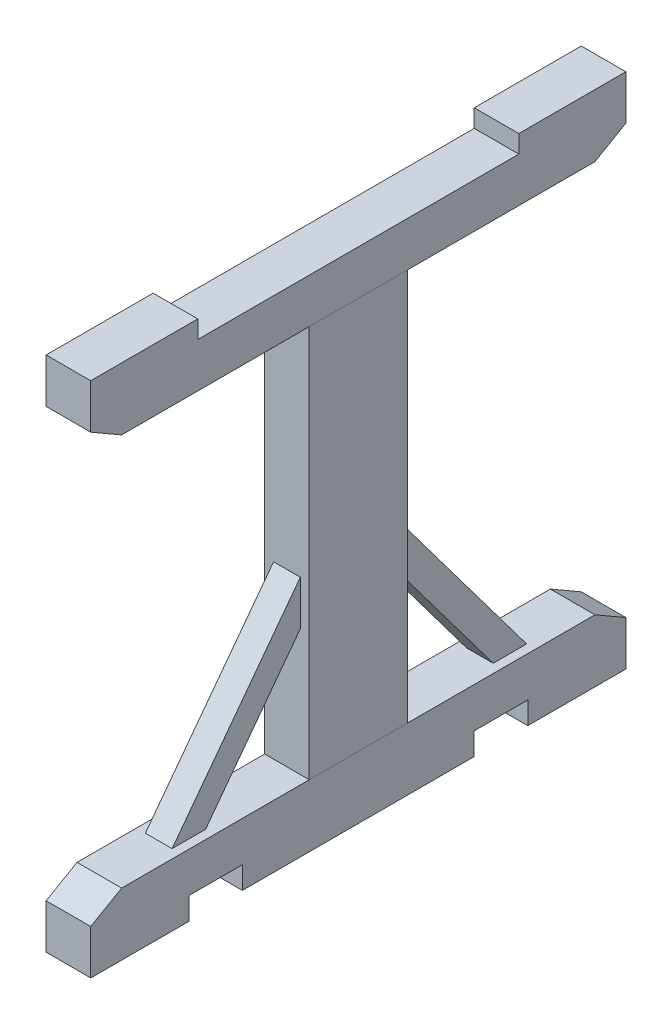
ISO-10303-21;
HEADER;
FILE_DESCRIPTION(('STEP AP214'),'2;1');
FILE_NAME('part.step','',(''),(''),'','','');
FILE_SCHEMA(('AUTOMOTIVE_DESIGN { 1 0 10303 214 1 1 1 1 }'));
ENDSEC;
DATA;
#1=APPLICATION_CONTEXT('core data for automotive mechanical design processes');
#2=APPLICATION_PROTOCOL_DEFINITION('international standard','automotive_design',2000,#1);
#3=PRODUCT_CONTEXT('',#1,'mechanical');
#4=PRODUCT('Part','Part','',(#3));
#5=PRODUCT_RELATED_PRODUCT_CATEGORY('part','',(#4));
#6=PRODUCT_DEFINITION_FORMATION('','',#4);
#7=PRODUCT_DEFINITION_CONTEXT('part definition',#1,'design');
#8=PRODUCT_DEFINITION('design','',#6,#7);
#9=PRODUCT_DEFINITION_SHAPE('','',#8);
#10=(LENGTH_UNIT() NAMED_UNIT(*) SI_UNIT(.MILLI.,.METRE.));
#11=(NAMED_UNIT(*) PLANE_ANGLE_UNIT() SI_UNIT($,.RADIAN.));
#12=(NAMED_UNIT(*) SI_UNIT($,.STERADIAN.) SOLID_ANGLE_UNIT());
#13=UNCERTAINTY_MEASURE_WITH_UNIT(LENGTH_MEASURE(1.E-05),#10,'distance_accuracy_value','');
#14=(GEOMETRIC_REPRESENTATION_CONTEXT(3) GLOBAL_UNCERTAINTY_ASSIGNED_CONTEXT((#13)) GLOBAL_UNIT_ASSIGNED_CONTEXT((#10,
#11,#12)) REPRESENTATION_CONTEXT('',''));
#15=CARTESIAN_POINT('',(0.,0.,0.));
#16=DIRECTION('',(0.,0.,1.));
#17=DIRECTION('',(1.,0.,0.));
#18=AXIS2_PLACEMENT_3D('',#15,#16,#17);
#19=CARTESIAN_POINT('',(-35.8178568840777,14.9999999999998,44.4500000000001));
#20=DIRECTION('',(0.,-1.,0.));
#21=DIRECTION('',(1.,0.,0.));
#22=AXIS2_PLACEMENT_3D('',#19,#20,#21);
#23=CYLINDRICAL_SURFACE('',#22,5.);
#24=CARTESIAN_POINT('',(-35.8178568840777,14.9999999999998,44.4500000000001));
#25=DIRECTION('',(0.,1.,0.));
#26=DIRECTION('',(-1.,0.,0.));
#27=AXIS2_PLACEMENT_3D('',#24,#25,#26);
#28=CIRCLE('',#27,5.);
#29=CARTESIAN_POINT('',(-40.8178568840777,14.9999999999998,44.4500000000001));
#30=VERTEX_POINT('',#29);
#31=EDGE_CURVE('E13',#30,#30,#28,.T.);
#32=ORIENTED_EDGE('',*,*,#31,.F.);
#33=EDGE_LOOP('',(#32));
#34=FACE_BOUND('',#33,.T.);
#35=CARTESIAN_POINT('',(-35.8178568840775,-15.0000000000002,44.4500000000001));
#36=DIRECTION('',(0.,1.,0.));
#37=DIRECTION('',(-1.,0.,0.));
#38=AXIS2_PLACEMENT_3D('',#35,#36,#37);
#39=CIRCLE('',#38,5.);
#40=CARTESIAN_POINT('',(-40.8178568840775,-15.0000000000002,44.4500000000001));
#41=VERTEX_POINT('',#40);
#42=EDGE_CURVE('E88',#41,#41,#39,.T.);
#43=ORIENTED_EDGE('',*,*,#42,.T.);
#44=EDGE_LOOP('',(#43));
#45=FACE_BOUND('',#44,.T.);
#46=ADVANCED_FACE('F85',(#34,#45),#23,.T.);
#47=CARTESIAN_POINT('',(-35.8178568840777,14.9999999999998,44.4500000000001));
#48=DIRECTION('',(0.,1.,0.));
#49=DIRECTION('',(-1.,0.,0.));
#50=AXIS2_PLACEMENT_3D('',#47,#48,#49);
#51=PLANE('',#50);
#52=ORIENTED_EDGE('',*,*,#31,.T.);
#53=EDGE_LOOP('',(#52));
#54=FACE_BOUND('',#53,.T.);
#55=ADVANCED_FACE('F100',(#54),#51,.T.);
#56=CARTESIAN_POINT('',(-35.8178568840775,-15.0000000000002,44.4500000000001));
#57=DIRECTION('',(0.,1.,0.));
#58=DIRECTION('',(-1.,0.,0.));
#59=AXIS2_PLACEMENT_3D('',#56,#57,#58);
#60=PLANE('',#59);
#61=ORIENTED_EDGE('',*,*,#42,.F.);
#62=EDGE_LOOP('',(#61));
#63=FACE_BOUND('',#62,.T.);
#64=ADVANCED_FACE('F98',(#63),#60,.F.);
#65=CLOSED_SHELL('',(#46,#55,#64));
#66=MANIFOLD_SOLID_BREP('B2',#65);
#67=CARTESIAN_POINT('',(-35.8178568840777,14.9999999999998,-44.4499999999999));
#68=DIRECTION('',(0.,-1.,0.));
#69=DIRECTION('',(1.,0.,0.));
#70=AXIS2_PLACEMENT_3D('',#67,#68,#69);
#71=CYLINDRICAL_SURFACE('',#70,5.);
#72=CARTESIAN_POINT('',(-35.8178568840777,14.9999999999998,-44.4499999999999));
#73=DIRECTION('',(0.,1.,0.));
#74=DIRECTION('',(-1.,0.,0.));
#75=AXIS2_PLACEMENT_3D('',#72,#73,#74);
#76=CIRCLE('',#75,5.);
#77=CARTESIAN_POINT('',(-40.8178568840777,14.9999999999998,-44.4499999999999));
#78=VERTEX_POINT('',#77);
#79=EDGE_CURVE('E84',#78,#78,#76,.T.);
#80=ORIENTED_EDGE('',*,*,#79,.F.);
#81=EDGE_LOOP('',(#80));
#82=FACE_BOUND('',#81,.T.);
#83=CARTESIAN_POINT('',(-35.8178568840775,-15.0000000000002,-44.4499999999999));
#84=DIRECTION('',(0.,1.,0.));
#85=DIRECTION('',(-1.,0.,0.));
#86=AXIS2_PLACEMENT_3D('',#83,#84,#85);
#87=CIRCLE('',#86,5.);
#88=CARTESIAN_POINT('',(-40.8178568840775,-15.0000000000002,-44.4499999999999));
#89=VERTEX_POINT('',#88);
#90=EDGE_CURVE('E139',#89,#89,#87,.T.);
#91=ORIENTED_EDGE('',*,*,#90,.T.);
#92=EDGE_LOOP('',(#91));
#93=FACE_BOUND('',#92,.T.);
#94=ADVANCED_FACE('F136',(#82,#93),#71,.T.);
#95=CARTESIAN_POINT('',(-35.8178568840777,14.9999999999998,-44.4499999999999));
#96=DIRECTION('',(0.,1.,0.));
#97=DIRECTION('',(-1.,0.,0.));
#98=AXIS2_PLACEMENT_3D('',#95,#96,#97);
#99=PLANE('',#98);
#100=ORIENTED_EDGE('',*,*,#79,.T.);
#101=EDGE_LOOP('',(#100));
#102=FACE_BOUND('',#101,.T.);
#103=ADVANCED_FACE('F151',(#102),#99,.T.);
#104=CARTESIAN_POINT('',(-35.8178568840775,-15.0000000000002,-44.4499999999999));
#105=DIRECTION('',(0.,1.,0.));
#106=DIRECTION('',(-1.,0.,0.));
#107=AXIS2_PLACEMENT_3D('',#104,#105,#106);
#108=PLANE('',#107);
#109=ORIENTED_EDGE('',*,*,#90,.F.);
#110=EDGE_LOOP('',(#109));
#111=FACE_BOUND('',#110,.T.);
#112=ADVANCED_FACE('F149',(#111),#108,.F.);
#113=CLOSED_SHELL('',(#94,#103,#112));
#114=MANIFOLD_SOLID_BREP('B8',#113);
#115=CARTESIAN_POINT('',(-35.8178568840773,0.,0.));
#116=DIRECTION('',(0.,1.,0.));
#117=DIRECTION('',(-1.,0.,0.));
#118=AXIS2_PLACEMENT_3D('',#115,#116,#117);
#119=PLANE('',#118);
#120=DIRECTION('',(0.,0.,-1.));
#121=VECTOR('',#120,1.);
#122=CARTESIAN_POINT('',(-16.7678568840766,0.,15.2399999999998));
#123=LINE('',#122,#121);
#124=CARTESIAN_POINT('',(-16.7678568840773,0.,-204.7875));
#125=VERTEX_POINT('',#124);
#126=CARTESIAN_POINT('',(-16.7678568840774,0.,-252.4125));
#127=VERTEX_POINT('',#126);
#128=EDGE_CURVE('E134',#125,#127,#123,.T.);
#129=ORIENTED_EDGE('',*,*,#128,.F.);
#130=DIRECTION('',(1.,0.,0.));
#131=VECTOR('',#130,1.);
#132=CARTESIAN_POINT('',(-16.7678568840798,0.,-204.7875));
#133=LINE('',#132,#131);
#134=CARTESIAN_POINT('',(-54.8678568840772,0.,-204.7875));
#135=VERTEX_POINT('',#134);
#136=EDGE_CURVE('E238',#135,#125,#133,.T.);
#137=ORIENTED_EDGE('',*,*,#136,.F.);
#138=DIRECTION('',(0.,0.,1.));
#139=VECTOR('',#138,1.);
#140=CARTESIAN_POINT('',(-54.8678568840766,0.,15.2399999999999));
#141=LINE('',#140,#139);
#142=CARTESIAN_POINT('',(-54.8678568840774,0.,-252.4125));
#143=VERTEX_POINT('',#142);
#144=EDGE_CURVE('E259',#143,#135,#141,.T.);
#145=ORIENTED_EDGE('',*,*,#144,.F.);
#146=DIRECTION('',(-1.,0.,0.));
#147=VECTOR('',#146,1.);
#148=CARTESIAN_POINT('',(-16.7678568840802,0.,-252.4125));
#149=LINE('',#148,#147);
#150=EDGE_CURVE('E197',#127,#143,#149,.T.);
#151=ORIENTED_EDGE('',*,*,#150,.F.);
#152=EDGE_LOOP('',(#129,#137,#145,#151));
#153=FACE_BOUND('',#152,.T.);
#154=ADVANCED_FACE('F187',(#153),#119,.F.);
#155=CARTESIAN_POINT('',(-16.7678568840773,293.37,15.2399999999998));
#156=DIRECTION('',(-1.,0.,0.));
#157=DIRECTION('',(0.,0.,1.));
#158=AXIS2_PLACEMENT_3D('',#155,#156,#157);
#159=PLANE('',#158);
#160=DIRECTION('',(0.,-0.8,-0.6));
#161=VECTOR('',#160,1.);
#162=CARTESIAN_POINT('',(-16.7678568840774,316.23,-15.2400000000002));
#163=LINE('',#162,#161);
#164=CARTESIAN_POINT('',(-16.7678568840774,316.23,-15.2400000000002));
#165=VERTEX_POINT('',#164);
#166=EDGE_CURVE('E204',#165,#127,#163,.T.);
#167=ORIENTED_EDGE('',*,*,#166,.F.);
#168=DIRECTION('',(0.,0.6,-0.8));
#169=VECTOR('',#168,1.);
#170=CARTESIAN_POINT('',(-16.7678568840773,293.37,15.2399999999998));
#171=LINE('',#170,#169);
#172=CARTESIAN_POINT('',(-16.7678568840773,293.37,15.2399999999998));
#173=VERTEX_POINT('',#172);
#174=EDGE_CURVE('E231',#173,#165,#171,.T.);
#175=ORIENTED_EDGE('',*,*,#174,.F.);
#176=DIRECTION('',(0.,-0.8,-0.6));
#177=VECTOR('',#176,1.);
#178=CARTESIAN_POINT('',(-16.7678568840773,293.37,15.2399999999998));
#179=LINE('',#178,#177);
#180=EDGE_CURVE('E243',#173,#125,#179,.T.);
#181=ORIENTED_EDGE('',*,*,#180,.T.);
#182=ORIENTED_EDGE('',*,*,#128,.T.);
#183=EDGE_LOOP('',(#167,#175,#181,#182));
#184=FACE_BOUND('',#183,.T.);
#185=ADVANCED_FACE('F242',(#184),#159,.F.);
#186=CARTESIAN_POINT('',(-16.7678568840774,316.23,-15.2400000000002));
#187=DIRECTION('',(0.,-0.6,0.8));
#188=DIRECTION('',(0.,-0.8,-0.6));
#189=AXIS2_PLACEMENT_3D('',#186,#187,#188);
#190=PLANE('',#189);
#191=DIRECTION('',(0.,-0.8,-0.6));
#192=VECTOR('',#191,1.);
#193=CARTESIAN_POINT('',(-54.8678568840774,316.23,-15.2400000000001));
#194=LINE('',#193,#192);
#195=CARTESIAN_POINT('',(-54.8678568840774,316.23,-15.2400000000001));
#196=VERTEX_POINT('',#195);
#197=EDGE_CURVE('E255',#196,#143,#194,.T.);
#198=ORIENTED_EDGE('',*,*,#197,.F.);
#199=DIRECTION('',(-1.,0.,0.));
#200=VECTOR('',#199,1.);
#201=CARTESIAN_POINT('',(-16.7678568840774,316.23,-15.2400000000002));
#202=LINE('',#201,#200);
#203=EDGE_CURVE('E245',#165,#196,#202,.T.);
#204=ORIENTED_EDGE('',*,*,#203,.F.);
#205=ORIENTED_EDGE('',*,*,#166,.T.);
#206=ORIENTED_EDGE('',*,*,#150,.T.);
#207=EDGE_LOOP('',(#198,#204,#205,#206));
#208=FACE_BOUND('',#207,.T.);
#209=ADVANCED_FACE('F269',(#208),#190,.F.);
#210=CARTESIAN_POINT('',(-54.8678568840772,293.37,15.2399999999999));
#211=DIRECTION('',(1.,0.,0.));
#212=DIRECTION('',(0.,0.,-1.));
#213=AXIS2_PLACEMENT_3D('',#210,#211,#212);
#214=PLANE('',#213);
#215=ORIENTED_EDGE('',*,*,#144,.T.);
#216=DIRECTION('',(0.,-0.8,-0.6));
#217=VECTOR('',#216,1.);
#218=CARTESIAN_POINT('',(-54.8678568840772,293.37,15.2399999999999));
#219=LINE('',#218,#217);
#220=CARTESIAN_POINT('',(-54.8678568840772,293.37,15.2399999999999));
#221=VERTEX_POINT('',#220);
#222=EDGE_CURVE('E249',#221,#135,#219,.T.);
#223=ORIENTED_EDGE('',*,*,#222,.F.);
#224=DIRECTION('',(0.,-0.6,0.8));
#225=VECTOR('',#224,1.);
#226=CARTESIAN_POINT('',(-54.8678568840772,293.37,15.2399999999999));
#227=LINE('',#226,#225);
#228=EDGE_CURVE('E233',#196,#221,#227,.T.);
#229=ORIENTED_EDGE('',*,*,#228,.F.);
#230=ORIENTED_EDGE('',*,*,#197,.T.);
#231=EDGE_LOOP('',(#215,#223,#229,#230));
#232=FACE_BOUND('',#231,.T.);
#233=ADVANCED_FACE('F189',(#232),#214,.F.);
#234=CARTESIAN_POINT('',(-16.7678568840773,293.37,15.2399999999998));
#235=DIRECTION('',(0.,0.6,-0.8));
#236=DIRECTION('',(0.,0.8,0.6));
#237=AXIS2_PLACEMENT_3D('',#234,#235,#236);
#238=PLANE('',#237);
#239=ORIENTED_EDGE('',*,*,#180,.F.);
#240=DIRECTION('',(1.,0.,0.));
#241=VECTOR('',#240,1.);
#242=CARTESIAN_POINT('',(-16.7678568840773,293.37,15.2399999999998));
#243=LINE('',#242,#241);
#244=EDGE_CURVE('E227',#221,#173,#243,.T.);
#245=ORIENTED_EDGE('',*,*,#244,.F.);
#246=ORIENTED_EDGE('',*,*,#222,.T.);
#247=ORIENTED_EDGE('',*,*,#136,.T.);
#248=EDGE_LOOP('',(#239,#245,#246,#247));
#249=FACE_BOUND('',#248,.T.);
#250=ADVANCED_FACE('F247',(#249),#238,.F.);
#251=CARTESIAN_POINT('',(-54.8678568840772,293.37,15.2399999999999));
#252=DIRECTION('',(0.,-0.8,-0.6));
#253=DIRECTION('',(-1.,0.,0.));
#254=AXIS2_PLACEMENT_3D('',#251,#252,#253);
#255=PLANE('',#254);
#256=ORIENTED_EDGE('',*,*,#244,.T.);
#257=ORIENTED_EDGE('',*,*,#174,.T.);
#258=ORIENTED_EDGE('',*,*,#203,.T.);
#259=ORIENTED_EDGE('',*,*,#228,.T.);
#260=EDGE_LOOP('',(#256,#257,#258,#259));
#261=FACE_BOUND('',#260,.T.);
#262=ADVANCED_FACE('F229',(#261),#255,.F.);
#263=CLOSED_SHELL('',(#154,#185,#209,#233,#250,#262));
#264=MANIFOLD_SOLID_BREP('B79',#263);
#265=CARTESIAN_POINT('',(-35.8178568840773,0.,0.));
#266=DIRECTION('',(0.,1.,0.));
#267=DIRECTION('',(-1.,0.,0.));
#268=AXIS2_PLACEMENT_3D('',#265,#266,#267);
#269=PLANE('',#268);
#270=DIRECTION('',(1.,0.,0.));
#271=VECTOR('',#270,1.);
#272=CARTESIAN_POINT('',(-16.7678568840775,0.,252.4125));
#273=LINE('',#272,#271);
#274=CARTESIAN_POINT('',(-54.8678568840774,0.,252.4125));
#275=VERTEX_POINT('',#274);
#276=CARTESIAN_POINT('',(-16.7678568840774,0.,252.4125));
#277=VERTEX_POINT('',#276);
#278=EDGE_CURVE('E338',#275,#277,#273,.T.);
#279=ORIENTED_EDGE('',*,*,#278,.F.);
#280=DIRECTION('',(0.,0.,1.));
#281=VECTOR('',#280,1.);
#282=CARTESIAN_POINT('',(-54.8678568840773,0.,213.36));
#283=LINE('',#282,#281);
#284=CARTESIAN_POINT('',(-54.8678568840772,0.,204.7875));
#285=VERTEX_POINT('',#284);
#286=EDGE_CURVE('E397',#285,#275,#283,.T.);
#287=ORIENTED_EDGE('',*,*,#286,.F.);
#288=DIRECTION('',(-1.,0.,0.));
#289=VECTOR('',#288,1.);
#290=CARTESIAN_POINT('',(-16.7678568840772,0.,204.7875));
#291=LINE('',#290,#289);
#292=CARTESIAN_POINT('',(-16.7678568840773,0.,204.7875));
#293=VERTEX_POINT('',#292);
#294=EDGE_CURVE('E384',#293,#285,#291,.T.);
#295=ORIENTED_EDGE('',*,*,#294,.F.);
#296=DIRECTION('',(0.,0.,-1.));
#297=VECTOR('',#296,1.);
#298=CARTESIAN_POINT('',(-16.7678568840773,-1.11022302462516E-13,213.36));
#299=LINE('',#298,#297);
#300=EDGE_CURVE('E185',#277,#293,#299,.T.);
#301=ORIENTED_EDGE('',*,*,#300,.F.);
#302=EDGE_LOOP('',(#279,#287,#295,#301));
#303=FACE_BOUND('',#302,.T.);
#304=ADVANCED_FACE('F329',(#303),#269,.F.);
#305=CARTESIAN_POINT('',(-16.7678568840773,-11.4299999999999,213.36));
#306=DIRECTION('',(-1.,0.,0.));
#307=DIRECTION('',(0.,0.,1.));
#308=AXIS2_PLACEMENT_3D('',#305,#306,#307);
#309=PLANE('',#308);
#310=ORIENTED_EDGE('',*,*,#300,.T.);
#311=DIRECTION('',(0.,0.8,-0.6));
#312=VECTOR('',#311,1.);
#313=CARTESIAN_POINT('',(-16.7678568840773,-11.4299999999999,213.36));
#314=LINE('',#313,#312);
#315=CARTESIAN_POINT('',(-16.7678568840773,293.37,-15.2399999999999));
#316=VERTEX_POINT('',#315);
#317=EDGE_CURVE('E368',#293,#316,#314,.T.);
#318=ORIENTED_EDGE('',*,*,#317,.T.);
#319=DIRECTION('',(0.,0.6,0.8));
#320=VECTOR('',#319,1.);
#321=CARTESIAN_POINT('',(-16.7678568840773,293.37,-15.2399999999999));
#322=LINE('',#321,#320);
#323=CARTESIAN_POINT('',(-16.7678568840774,316.23,15.2400000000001));
#324=VERTEX_POINT('',#323);
#325=EDGE_CURVE('E371',#316,#324,#322,.T.);
#326=ORIENTED_EDGE('',*,*,#325,.T.);
#327=DIRECTION('',(0.,0.8,-0.6));
#328=VECTOR('',#327,1.);
#329=CARTESIAN_POINT('',(-16.7678568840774,11.4300000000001,243.84));
#330=LINE('',#329,#328);
#331=EDGE_CURVE('E403',#277,#324,#330,.T.);
#332=ORIENTED_EDGE('',*,*,#331,.F.);
#333=EDGE_LOOP('',(#310,#318,#326,#332));
#334=FACE_BOUND('',#333,.T.);
#335=ADVANCED_FACE('F331',(#334),#309,.F.);
#336=CARTESIAN_POINT('',(-16.7678568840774,11.4300000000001,243.84));
#337=DIRECTION('',(0.,-0.6,-0.8));
#338=DIRECTION('',(0.,0.8,-0.6));
#339=AXIS2_PLACEMENT_3D('',#336,#337,#338);
#340=PLANE('',#339);
#341=ORIENTED_EDGE('',*,*,#331,.T.);
#342=DIRECTION('',(-1.,0.,0.));
#343=VECTOR('',#342,1.);
#344=CARTESIAN_POINT('',(-16.7678568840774,316.23,15.24));
#345=LINE('',#344,#343);
#346=CARTESIAN_POINT('',(-54.8678568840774,316.23,15.2399999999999));
#347=VERTEX_POINT('',#346);
#348=EDGE_CURVE('E388',#324,#347,#345,.T.);
#349=ORIENTED_EDGE('',*,*,#348,.T.);
#350=DIRECTION('',(0.,0.8,-0.6));
#351=VECTOR('',#350,1.);
#352=CARTESIAN_POINT('',(-54.8678568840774,11.43,243.84));
#353=LINE('',#352,#351);
#354=EDGE_CURVE('E395',#275,#347,#353,.T.);
#355=ORIENTED_EDGE('',*,*,#354,.F.);
#356=ORIENTED_EDGE('',*,*,#278,.T.);
#357=EDGE_LOOP('',(#341,#349,#355,#356));
#358=FACE_BOUND('',#357,.T.);
#359=ADVANCED_FACE('F409',(#358),#340,.F.);
#360=CARTESIAN_POINT('',(-54.8678568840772,-11.43,213.36));
#361=DIRECTION('',(1.,0.,0.));
#362=DIRECTION('',(0.,0.,-1.));
#363=AXIS2_PLACEMENT_3D('',#360,#361,#362);
#364=PLANE('',#363);
#365=ORIENTED_EDGE('',*,*,#354,.T.);
#366=DIRECTION('',(0.,-0.6,-0.8));
#367=VECTOR('',#366,1.);
#368=CARTESIAN_POINT('',(-54.8678568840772,293.37,-15.2400000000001));
#369=LINE('',#368,#367);
#370=CARTESIAN_POINT('',(-54.8678568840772,293.37,-15.2400000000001));
#371=VERTEX_POINT('',#370);
#372=EDGE_CURVE('E390',#347,#371,#369,.T.);
#373=ORIENTED_EDGE('',*,*,#372,.T.);
#374=DIRECTION('',(0.,0.8,-0.6));
#375=VECTOR('',#374,1.);
#376=CARTESIAN_POINT('',(-54.8678568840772,-11.43,213.36));
#377=LINE('',#376,#375);
#378=EDGE_CURVE('E380',#285,#371,#377,.T.);
#379=ORIENTED_EDGE('',*,*,#378,.F.);
#380=ORIENTED_EDGE('',*,*,#286,.T.);
#381=EDGE_LOOP('',(#365,#373,#379,#380));
#382=FACE_BOUND('',#381,.T.);
#383=ADVANCED_FACE('F411',(#382),#364,.F.);
#384=CARTESIAN_POINT('',(-16.7678568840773,-11.4299999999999,213.36));
#385=DIRECTION('',(0.,0.6,0.8));
#386=DIRECTION('',(0.,-0.8,0.6));
#387=AXIS2_PLACEMENT_3D('',#384,#385,#386);
#388=PLANE('',#387);
#389=DIRECTION('',(1.,0.,0.));
#390=VECTOR('',#389,1.);
#391=CARTESIAN_POINT('',(-16.7678568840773,293.37,-15.2399999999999));
#392=LINE('',#391,#390);
#393=EDGE_CURVE('E375',#371,#316,#392,.T.);
#394=ORIENTED_EDGE('',*,*,#393,.T.);
#395=ORIENTED_EDGE('',*,*,#317,.F.);
#396=ORIENTED_EDGE('',*,*,#294,.T.);
#397=ORIENTED_EDGE('',*,*,#378,.T.);
#398=EDGE_LOOP('',(#394,#395,#396,#397));
#399=FACE_BOUND('',#398,.T.);
#400=ADVANCED_FACE('F378',(#399),#388,.F.);
#401=CARTESIAN_POINT('',(-54.8678568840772,293.37,-15.2400000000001));
#402=DIRECTION('',(0.,0.8,-0.6));
#403=DIRECTION('',(-1.,0.,0.));
#404=AXIS2_PLACEMENT_3D('',#401,#402,#403);
#405=PLANE('',#404);
#406=ORIENTED_EDGE('',*,*,#393,.F.);
#407=ORIENTED_EDGE('',*,*,#372,.F.);
#408=ORIENTED_EDGE('',*,*,#348,.F.);
#409=ORIENTED_EDGE('',*,*,#325,.F.);
#410=EDGE_LOOP('',(#406,#407,#408,#409));
#411=FACE_BOUND('',#410,.T.);
#412=ADVANCED_FACE('F386',(#411),#405,.T.);
#413=CLOSED_SHELL('',(#304,#335,#359,#383,#400,#412));
#414=MANIFOLD_SOLID_BREP('B128',#413);
#415=CARTESIAN_POINT('',(-67.5678568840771,558.8,69.8500000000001));
#416=DIRECTION('',(1.,0.,0.));
#417=DIRECTION('',(0.,0.,-1.));
#418=AXIS2_PLACEMENT_3D('',#415,#416,#417);
#419=PLANE('',#418);
#420=DIRECTION('',(0.,0.,1.));
#421=VECTOR('',#420,1.);
#422=CARTESIAN_POINT('',(-67.5678568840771,0.,69.8500000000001));
#423=LINE('',#422,#421);
#424=CARTESIAN_POINT('',(-67.5678568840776,0.,-69.8499999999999));
#425=VERTEX_POINT('',#424);
#426=CARTESIAN_POINT('',(-67.5678568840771,0.,69.8500000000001));
#427=VERTEX_POINT('',#426);
#428=EDGE_CURVE('E513',#425,#427,#423,.T.);
#429=ORIENTED_EDGE('',*,*,#428,.T.);
#430=DIRECTION('',(0.,-1.,0.));
#431=VECTOR('',#430,1.);
#432=CARTESIAN_POINT('',(-67.5678568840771,558.8,69.8500000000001));
#433=LINE('',#432,#431);
#434=CARTESIAN_POINT('',(-67.5678568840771,558.8,69.8500000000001));
#435=VERTEX_POINT('',#434);
#436=EDGE_CURVE('E534',#435,#427,#433,.T.);
#437=ORIENTED_EDGE('',*,*,#436,.F.);
#438=DIRECTION('',(0.,0.,1.));
#439=VECTOR('',#438,1.);
#440=CARTESIAN_POINT('',(-67.5678568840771,558.8,69.8500000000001));
#441=LINE('',#440,#439);
#442=CARTESIAN_POINT('',(-67.5678568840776,558.8,-69.8499999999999));
#443=VERTEX_POINT('',#442);
#444=EDGE_CURVE('E490',#443,#435,#441,.T.);
#445=ORIENTED_EDGE('',*,*,#444,.F.);
#446=DIRECTION('',(0.,-1.,0.));
#447=VECTOR('',#446,1.);
#448=CARTESIAN_POINT('',(-67.5678568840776,558.8,-69.8499999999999));
#449=LINE('',#448,#447);
#450=EDGE_CURVE('E530',#443,#425,#449,.T.);
#451=ORIENTED_EDGE('',*,*,#450,.T.);
#452=EDGE_LOOP('',(#429,#437,#445,#451));
#453=FACE_BOUND('',#452,.T.);
#454=CARTESIAN_POINT('',(-67.5678568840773,222.25,7.35175809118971E-12));
#455=DIRECTION('',(1.,0.,0.));
#456=DIRECTION('',(0.,0.,-1.));
#457=AXIS2_PLACEMENT_3D('',#454,#455,#456);
#458=CIRCLE('',#457,5.2625);
#459=CARTESIAN_POINT('',(-67.5678568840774,222.25,-5.26249999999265));
#460=VERTEX_POINT('',#459);
#461=EDGE_CURVE('E475',#460,#460,#458,.F.);
#462=ORIENTED_EDGE('',*,*,#461,.F.);
#463=EDGE_LOOP('',(#462));
#464=FACE_BOUND('',#463,.T.);
#465=ADVANCED_FACE('F471',(#453,#464),#419,.F.);
#466=CARTESIAN_POINT('',(-4.0678568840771,558.8,69.8499999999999));
#467=DIRECTION('',(0.,0.,-1.));
#468=DIRECTION('',(-1.,0.,0.));
#469=AXIS2_PLACEMENT_3D('',#466,#467,#468);
#470=PLANE('',#469);
#471=DIRECTION('',(1.,0.,0.));
#472=VECTOR('',#471,1.);
#473=CARTESIAN_POINT('',(-4.06785688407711,0.,69.8499999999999));
#474=LINE('',#473,#472);
#475=CARTESIAN_POINT('',(-4.06785688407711,0.,69.8499999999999));
#476=VERTEX_POINT('',#475);
#477=EDGE_CURVE('E538',#427,#476,#474,.T.);
#478=ORIENTED_EDGE('',*,*,#477,.T.);
#479=DIRECTION('',(0.,-1.,0.));
#480=VECTOR('',#479,1.);
#481=CARTESIAN_POINT('',(-4.0678568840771,558.8,69.8499999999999));
#482=LINE('',#481,#480);
#483=CARTESIAN_POINT('',(-4.0678568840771,558.8,69.8499999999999));
#484=VERTEX_POINT('',#483);
#485=EDGE_CURVE('E327',#484,#476,#482,.T.);
#486=ORIENTED_EDGE('',*,*,#485,.F.);
#487=DIRECTION('',(1.,0.,0.));
#488=VECTOR('',#487,1.);
#489=CARTESIAN_POINT('',(-4.0678568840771,558.8,69.8499999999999));
#490=LINE('',#489,#488);
#491=EDGE_CURVE('E525',#435,#484,#490,.T.);
#492=ORIENTED_EDGE('',*,*,#491,.F.);
#493=ORIENTED_EDGE('',*,*,#436,.T.);
#494=EDGE_LOOP('',(#478,#486,#492,#493));
#495=FACE_BOUND('',#494,.T.);
#496=ADVANCED_FACE('F473',(#495),#470,.F.);
#497=CARTESIAN_POINT('',(-4.0678568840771,558.8,69.8499999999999));
#498=DIRECTION('',(-1.,0.,0.));
#499=DIRECTION('',(0.,0.,1.));
#500=AXIS2_PLACEMENT_3D('',#497,#498,#499);
#501=PLANE('',#500);
#502=DIRECTION('',(0.,0.,-1.));
#503=VECTOR('',#502,1.);
#504=CARTESIAN_POINT('',(-4.06785688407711,0.,69.8499999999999));
#505=LINE('',#504,#503);
#506=CARTESIAN_POINT('',(-4.06785688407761,0.,-69.8500000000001));
#507=VERTEX_POINT('',#506);
#508=EDGE_CURVE('E529',#476,#507,#505,.T.);
#509=ORIENTED_EDGE('',*,*,#508,.T.);
#510=DIRECTION('',(0.,-1.,0.));
#511=VECTOR('',#510,1.);
#512=CARTESIAN_POINT('',(-4.06785688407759,558.8,-69.8500000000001));
#513=LINE('',#512,#511);
#514=CARTESIAN_POINT('',(-4.06785688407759,558.8,-69.8500000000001));
#515=VERTEX_POINT('',#514);
#516=EDGE_CURVE('E481',#515,#507,#513,.T.);
#517=ORIENTED_EDGE('',*,*,#516,.F.);
#518=DIRECTION('',(0.,0.,-1.));
#519=VECTOR('',#518,1.);
#520=CARTESIAN_POINT('',(-4.0678568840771,558.8,69.8499999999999));
#521=LINE('',#520,#519);
#522=EDGE_CURVE('E520',#484,#515,#521,.T.);
#523=ORIENTED_EDGE('',*,*,#522,.F.);
#524=ORIENTED_EDGE('',*,*,#485,.T.);
#525=EDGE_LOOP('',(#509,#517,#523,#524));
#526=FACE_BOUND('',#525,.T.);
#527=ADVANCED_FACE('F528',(#526),#501,.F.);
#528=CARTESIAN_POINT('',(-4.06785688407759,558.8,-69.8500000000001));
#529=DIRECTION('',(0.,0.,1.));
#530=DIRECTION('',(1.,0.,0.));
#531=AXIS2_PLACEMENT_3D('',#528,#529,#530);
#532=PLANE('',#531);
#533=DIRECTION('',(-1.,0.,0.));
#534=VECTOR('',#533,1.);
#535=CARTESIAN_POINT('',(-4.06785688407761,0.,-69.8500000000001));
#536=LINE('',#535,#534);
#537=EDGE_CURVE('E507',#507,#425,#536,.T.);
#538=ORIENTED_EDGE('',*,*,#537,.T.);
#539=ORIENTED_EDGE('',*,*,#450,.F.);
#540=DIRECTION('',(-1.,0.,0.));
#541=VECTOR('',#540,1.);
#542=CARTESIAN_POINT('',(-4.06785688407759,558.8,-69.8500000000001));
#543=LINE('',#542,#541);
#544=EDGE_CURVE('E523',#515,#443,#543,.T.);
#545=ORIENTED_EDGE('',*,*,#544,.F.);
#546=ORIENTED_EDGE('',*,*,#516,.T.);
#547=EDGE_LOOP('',(#538,#539,#545,#546));
#548=FACE_BOUND('',#547,.T.);
#549=ADVANCED_FACE('F532',(#548),#532,.F.);
#550=CARTESIAN_POINT('',(-67.5678568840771,558.8,69.8500000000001));
#551=DIRECTION('',(0.,-1.,0.));
#552=DIRECTION('',(-1.,0.,0.));
#553=AXIS2_PLACEMENT_3D('',#550,#551,#552);
#554=PLANE('',#553);
#555=ORIENTED_EDGE('',*,*,#491,.T.);
#556=ORIENTED_EDGE('',*,*,#522,.T.);
#557=ORIENTED_EDGE('',*,*,#544,.T.);
#558=ORIENTED_EDGE('',*,*,#444,.T.);
#559=EDGE_LOOP('',(#555,#556,#557,#558));
#560=FACE_BOUND('',#559,.T.);
#561=ADVANCED_FACE('F521',(#560),#554,.F.);
#562=CARTESIAN_POINT('',(-67.5678568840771,0.,69.8500000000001));
#563=DIRECTION('',(0.,-1.,0.));
#564=DIRECTION('',(-1.,0.,0.));
#565=AXIS2_PLACEMENT_3D('',#562,#563,#564);
#566=PLANE('',#565);
#567=CARTESIAN_POINT('',(-35.8178568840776,0.,-44.4499999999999));
#568=DIRECTION('',(0.,-1.,0.));
#569=DIRECTION('',(0.,0.,-1.));
#570=AXIS2_PLACEMENT_3D('',#567,#568,#569);
#571=CIRCLE('',#570,5.1);
#572=CARTESIAN_POINT('',(-35.8178568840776,0.,-49.5499999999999));
#573=VERTEX_POINT('',#572);
#574=EDGE_CURVE('E541',#573,#573,#571,.T.);
#575=ORIENTED_EDGE('',*,*,#574,.F.);
#576=EDGE_LOOP('',(#575));
#577=FACE_BOUND('',#576,.T.);
#578=CARTESIAN_POINT('',(-35.8178568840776,0.,44.4500000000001));
#579=DIRECTION('',(0.,-1.,0.));
#580=DIRECTION('',(0.,0.,-1.));
#581=AXIS2_PLACEMENT_3D('',#578,#579,#580);
#582=CIRCLE('',#581,5.1);
#583=CARTESIAN_POINT('',(-35.8178568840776,0.,39.3500000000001));
#584=VERTEX_POINT('',#583);
#585=EDGE_CURVE('E547',#584,#584,#582,.T.);
#586=ORIENTED_EDGE('',*,*,#585,.F.);
#587=EDGE_LOOP('',(#586));
#588=FACE_BOUND('',#587,.T.);
#589=ORIENTED_EDGE('',*,*,#477,.F.);
#590=ORIENTED_EDGE('',*,*,#428,.F.);
#591=ORIENTED_EDGE('',*,*,#537,.F.);
#592=ORIENTED_EDGE('',*,*,#508,.F.);
#593=EDGE_LOOP('',(#589,#590,#591,#592));
#594=FACE_BOUND('',#593,.T.);
#595=ADVANCED_FACE('F556',(#577,#588,#594),#566,.T.);
#596=CARTESIAN_POINT('',(-35.8178568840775,-16.0000000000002,44.4500000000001));
#597=DIRECTION('',(0.,1.,0.));
#598=DIRECTION('',(-1.,0.,0.));
#599=AXIS2_PLACEMENT_3D('',#596,#597,#598);
#600=CYLINDRICAL_SURFACE('',#599,5.1);
#601=ORIENTED_EDGE('',*,*,#585,.T.);
#602=EDGE_LOOP('',(#601));
#603=FACE_BOUND('',#602,.T.);
#604=CARTESIAN_POINT('',(-35.8178568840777,15.9999999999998,44.4500000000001));
#605=DIRECTION('',(0.,1.,0.));
#606=DIRECTION('',(-1.,0.,0.));
#607=AXIS2_PLACEMENT_3D('',#604,#605,#606);
#608=CIRCLE('',#607,5.1);
#609=CARTESIAN_POINT('',(-40.9178568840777,15.9999999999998,44.4500000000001));
#610=VERTEX_POINT('',#609);
#611=EDGE_CURVE('E571',#610,#610,#608,.T.);
#612=ORIENTED_EDGE('',*,*,#611,.T.);
#613=EDGE_LOOP('',(#612));
#614=FACE_BOUND('',#613,.T.);
#615=ADVANCED_FACE('F559',(#603,#614),#600,.F.);
#616=CARTESIAN_POINT('',(-35.8178568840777,15.9999999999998,44.4500000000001));
#617=DIRECTION('',(0.,1.,0.));
#618=DIRECTION('',(-1.,0.,0.));
#619=AXIS2_PLACEMENT_3D('',#616,#617,#618);
#620=PLANE('',#619);
#621=ORIENTED_EDGE('',*,*,#611,.F.);
#622=EDGE_LOOP('',(#621));
#623=FACE_BOUND('',#622,.T.);
#624=ADVANCED_FACE('F593',(#623),#620,.F.);
#625=CARTESIAN_POINT('',(-35.8178568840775,-16.0000000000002,-44.4499999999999));
#626=DIRECTION('',(0.,1.,0.));
#627=DIRECTION('',(-1.,0.,0.));
#628=AXIS2_PLACEMENT_3D('',#625,#626,#627);
#629=CYLINDRICAL_SURFACE('',#628,5.1);
#630=ORIENTED_EDGE('',*,*,#574,.T.);
#631=EDGE_LOOP('',(#630));
#632=FACE_BOUND('',#631,.T.);
#633=CARTESIAN_POINT('',(-35.8178568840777,15.9999999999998,-44.4499999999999));
#634=DIRECTION('',(0.,1.,0.));
#635=DIRECTION('',(-1.,0.,0.));
#636=AXIS2_PLACEMENT_3D('',#633,#634,#635);
#637=CIRCLE('',#636,5.1);
#638=CARTESIAN_POINT('',(-40.9178568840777,15.9999999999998,-44.4499999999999));
#639=VERTEX_POINT('',#638);
#640=EDGE_CURVE('E549',#639,#639,#637,.T.);
#641=ORIENTED_EDGE('',*,*,#640,.T.);
#642=EDGE_LOOP('',(#641));
#643=FACE_BOUND('',#642,.T.);
#644=ADVANCED_FACE('F553',(#632,#643),#629,.F.);
#645=CARTESIAN_POINT('',(-35.8178568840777,15.9999999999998,-44.4499999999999));
#646=DIRECTION('',(0.,1.,0.));
#647=DIRECTION('',(-1.,0.,0.));
#648=AXIS2_PLACEMENT_3D('',#645,#646,#647);
#649=PLANE('',#648);
#650=ORIENTED_EDGE('',*,*,#640,.F.);
#651=EDGE_LOOP('',(#650));
#652=FACE_BOUND('',#651,.T.);
#653=ADVANCED_FACE('F583',(#652),#649,.F.);
#654=CARTESIAN_POINT('',(-67.5678568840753,222.25,7.35175809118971E-12));
#655=DIRECTION('',(1.,0.,0.));
#656=DIRECTION('',(0.,0.,-1.));
#657=AXIS2_PLACEMENT_3D('',#654,#655,#656);
#658=CYLINDRICAL_SURFACE('',#657,5.2625);
#659=CARTESIAN_POINT('',(-46.5178568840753,222.25,7.35175809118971E-12));
#660=DIRECTION('',(1.,0.,0.));
#661=DIRECTION('',(0.,0.,-1.));
#662=AXIS2_PLACEMENT_3D('',#659,#660,#661);
#663=CIRCLE('',#662,5.2625);
#664=CARTESIAN_POINT('',(-46.5178568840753,222.25,-5.26249999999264));
#665=VERTEX_POINT('',#664);
#666=EDGE_CURVE('E572',#665,#665,#663,.T.);
#667=ORIENTED_EDGE('',*,*,#666,.T.);
#668=EDGE_LOOP('',(#667));
#669=FACE_BOUND('',#668,.T.);
#670=ORIENTED_EDGE('',*,*,#461,.T.);
#671=EDGE_LOOP('',(#670));
#672=FACE_BOUND('',#671,.T.);
#673=ADVANCED_FACE('F585',(#669,#672),#658,.F.);
#674=CARTESIAN_POINT('',(-46.5178568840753,222.25,7.35522753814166E-12));
#675=DIRECTION('',(-1.,0.,0.));
#676=DIRECTION('',(0.,0.,1.));
#677=AXIS2_PLACEMENT_3D('',#674,#675,#676);
#678=PLANE('',#677);
#679=ORIENTED_EDGE('',*,*,#666,.F.);
#680=EDGE_LOOP('',(#679));
#681=FACE_BOUND('',#680,.T.);
#682=ADVANCED_FACE('F591',(#681),#678,.T.);
#683=CLOSED_SHELL('',(#465,#496,#527,#549,#561,#595,#615,#624,#644,#653,#673,#682));
#684=MANIFOLD_SOLID_BREP('B179',#683);
#685=CARTESIAN_POINT('',(-4.06785688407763,-88.9000000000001,-381.));
#686=DIRECTION('',(0.,1.,0.));
#687=DIRECTION('',(-1.,0.,0.));
#688=AXIS2_PLACEMENT_3D('',#685,#686,#687);
#689=PLANE('',#688);
#690=DIRECTION('',(0.,0.,1.));
#691=VECTOR('',#690,1.);
#692=CARTESIAN_POINT('',(-67.5678568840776,-88.8999999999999,-381.));
#693=LINE('',#692,#691);
#694=CARTESIAN_POINT('',(-67.5678568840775,-88.8999999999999,241.3));
#695=VERTEX_POINT('',#694);
#696=CARTESIAN_POINT('',(-67.5678568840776,-88.8999999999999,381.));
#697=VERTEX_POINT('',#696);
#698=EDGE_CURVE('E844',#695,#697,#693,.T.);
#699=ORIENTED_EDGE('',*,*,#698,.F.);
#700=DIRECTION('',(1.,0.,0.));
#701=VECTOR('',#700,1.);
#702=CARTESIAN_POINT('',(-67.5688568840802,-88.8999999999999,241.3));
#703=LINE('',#702,#701);
#704=CARTESIAN_POINT('',(-4.0678568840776,-88.9000000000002,241.3));
#705=VERTEX_POINT('',#704);
#706=EDGE_CURVE('E826',#695,#705,#703,.T.);
#707=ORIENTED_EDGE('',*,*,#706,.T.);
#708=DIRECTION('',(0.,0.,1.));
#709=VECTOR('',#708,1.);
#710=CARTESIAN_POINT('',(-4.06785688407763,-88.9000000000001,-381.));
#711=LINE('',#710,#709);
#712=CARTESIAN_POINT('',(-4.06785688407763,-88.9000000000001,381.));
#713=VERTEX_POINT('',#712);
#714=EDGE_CURVE('E847',#705,#713,#711,.T.);
#715=ORIENTED_EDGE('',*,*,#714,.T.);
#716=DIRECTION('',(-1.,0.,0.));
#717=VECTOR('',#716,1.);
#718=CARTESIAN_POINT('',(-4.06785688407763,-88.9000000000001,381.));
#719=LINE('',#718,#717);
#720=EDGE_CURVE('E908',#713,#697,#719,.T.);
#721=ORIENTED_EDGE('',*,*,#720,.T.);
#722=EDGE_LOOP('',(#699,#707,#715,#721));
#723=FACE_BOUND('',#722,.T.);
#724=ADVANCED_FACE('F714',(#723),#689,.F.);
#725=CARTESIAN_POINT('',(-4.0678568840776,-88.9000000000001,-165.1));
#726=VERTEX_POINT('',#725);
#727=CARTESIAN_POINT('',(-4.0678568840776,-88.9000000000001,165.1));
#728=VERTEX_POINT('',#727);
#729=EDGE_CURVE('E835',#726,#728,#711,.T.);
#730=ORIENTED_EDGE('',*,*,#729,.T.);
#731=DIRECTION('',(1.,0.,0.));
#732=VECTOR('',#731,1.);
#733=CARTESIAN_POINT('',(-67.5688568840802,-88.8999999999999,165.1));
#734=LINE('',#733,#732);
#735=CARTESIAN_POINT('',(-67.5678568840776,-88.8999999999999,165.1));
#736=VERTEX_POINT('',#735);
#737=EDGE_CURVE('E820',#736,#728,#734,.T.);
#738=ORIENTED_EDGE('',*,*,#737,.F.);
#739=CARTESIAN_POINT('',(-67.5678568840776,-88.8999999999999,-165.1));
#740=VERTEX_POINT('',#739);
#741=EDGE_CURVE('E833',#740,#736,#693,.T.);
#742=ORIENTED_EDGE('',*,*,#741,.F.);
#743=DIRECTION('',(1.,0.,0.));
#744=VECTOR('',#743,1.);
#745=CARTESIAN_POINT('',(-67.5688568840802,-88.8999999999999,-165.1));
#746=LINE('',#745,#744);
#747=EDGE_CURVE('E918',#740,#726,#746,.T.);
#748=ORIENTED_EDGE('',*,*,#747,.T.);
#749=EDGE_LOOP('',(#730,#738,#742,#748));
#750=FACE_BOUND('',#749,.T.);
#751=ADVANCED_FACE('F831',(#750),#689,.F.);
#752=CARTESIAN_POINT('',(-4.06785688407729,-1.11022302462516E-13,-381.));
#753=DIRECTION('',(0.,-1.,0.));
#754=DIRECTION('',(1.,0.,0.));
#755=AXIS2_PLACEMENT_3D('',#752,#753,#754);
#756=PLANE('',#755);
#757=CARTESIAN_POINT('',(-35.8178568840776,0.,-44.4499999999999));
#758=DIRECTION('',(0.,-1.,0.));
#759=DIRECTION('',(1.,0.,0.));
#760=AXIS2_PLACEMENT_3D('',#757,#758,#759);
#761=CIRCLE('',#760,5.1);
#762=CARTESIAN_POINT('',(-30.7178568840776,0.,-44.4499999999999));
#763=VERTEX_POINT('',#762);
#764=EDGE_CURVE('E862',#763,#763,#761,.T.);
#765=ORIENTED_EDGE('',*,*,#764,.T.);
#766=EDGE_LOOP('',(#765));
#767=FACE_BOUND('',#766,.T.);
#768=CARTESIAN_POINT('',(-35.8178568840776,0.,44.4500000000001));
#769=DIRECTION('',(0.,-1.,0.));
#770=DIRECTION('',(1.,0.,0.));
#771=AXIS2_PLACEMENT_3D('',#768,#769,#770);
#772=CIRCLE('',#771,5.1);
#773=CARTESIAN_POINT('',(-30.7178568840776,0.,44.4500000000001));
#774=VERTEX_POINT('',#773);
#775=EDGE_CURVE('E859',#774,#774,#772,.T.);
#776=ORIENTED_EDGE('',*,*,#775,.T.);
#777=EDGE_LOOP('',(#776));
#778=FACE_BOUND('',#777,.T.);
#779=DIRECTION('',(0.,0.,1.));
#780=VECTOR('',#779,1.);
#781=CARTESIAN_POINT('',(-4.06785688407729,-1.11022302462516E-13,-381.));
#782=LINE('',#781,#780);
#783=CARTESIAN_POINT('',(-4.06785688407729,-1.11022302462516E-13,-337.00590948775));
#784=VERTEX_POINT('',#783);
#785=CARTESIAN_POINT('',(-4.06785688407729,0.,337.00590948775));
#786=VERTEX_POINT('',#785);
#787=EDGE_CURVE('E855',#784,#786,#782,.T.);
#788=ORIENTED_EDGE('',*,*,#787,.F.);
#789=DIRECTION('',(-1.,0.,0.));
#790=VECTOR('',#789,1.);
#791=CARTESIAN_POINT('',(-4.06785688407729,-1.11022302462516E-13,-337.00590948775));
#792=LINE('',#791,#790);
#793=CARTESIAN_POINT('',(-67.5678568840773,1.14491749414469E-13,-337.00590948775));
#794=VERTEX_POINT('',#793);
#795=EDGE_CURVE('E876',#784,#794,#792,.T.);
#796=ORIENTED_EDGE('',*,*,#795,.T.);
#797=DIRECTION('',(0.,0.,1.));
#798=VECTOR('',#797,1.);
#799=CARTESIAN_POINT('',(-67.5678568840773,1.11022302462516E-13,-381.));
#800=LINE('',#799,#798);
#801=CARTESIAN_POINT('',(-67.5678568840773,1.5897054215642E-13,337.00590948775));
#802=VERTEX_POINT('',#801);
#803=EDGE_CURVE('E848',#794,#802,#800,.T.);
#804=ORIENTED_EDGE('',*,*,#803,.T.);
#805=DIRECTION('',(1.,0.,0.));
#806=VECTOR('',#805,1.);
#807=CARTESIAN_POINT('',(-4.06785688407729,-1.11022302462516E-13,337.00590948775));
#808=LINE('',#807,#806);
#809=EDGE_CURVE('E873',#802,#786,#808,.T.);
#810=ORIENTED_EDGE('',*,*,#809,.T.);
#811=EDGE_LOOP('',(#788,#796,#804,#810));
#812=FACE_BOUND('',#811,.T.);
#813=ADVANCED_FACE('F899',(#767,#778,#812),#756,.F.);
#814=CARTESIAN_POINT('',(-4.06785688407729,-1.11022302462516E-13,-381.));
#815=DIRECTION('',(-1.,0.,0.));
#816=DIRECTION('',(0.,-1.,0.));
#817=AXIS2_PLACEMENT_3D('',#814,#815,#816);
#818=PLANE('',#817);
#819=DIRECTION('',(0.,-1.,0.));
#820=VECTOR('',#819,1.);
#821=CARTESIAN_POINT('',(-4.06785688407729,-1.11022302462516E-13,-381.));
#822=LINE('',#821,#820);
#823=CARTESIAN_POINT('',(-4.06785688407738,-25.4000000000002,-381.));
#824=VERTEX_POINT('',#823);
#825=CARTESIAN_POINT('',(-4.06785688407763,-88.9000000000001,-381.));
#826=VERTEX_POINT('',#825);
#827=EDGE_CURVE('E897',#824,#826,#822,.T.);
#828=ORIENTED_EDGE('',*,*,#827,.F.);
#829=DIRECTION('',(0.,-0.500000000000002,-0.866025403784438));
#830=VECTOR('',#829,1.);
#831=CARTESIAN_POINT('',(-4.06785688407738,-25.4000000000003,-381.));
#832=LINE('',#831,#830);
#833=EDGE_CURVE('E871',#824,#784,#832,.F.);
#834=ORIENTED_EDGE('',*,*,#833,.T.);
#835=ORIENTED_EDGE('',*,*,#787,.T.);
#836=DIRECTION('',(0.,-0.500000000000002,0.866025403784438));
#837=VECTOR('',#836,1.);
#838=CARTESIAN_POINT('',(-4.06785688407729,-1.11022302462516E-13,337.00590948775));
#839=LINE('',#838,#837);
#840=CARTESIAN_POINT('',(-4.06785688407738,-25.4000000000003,381.));
#841=VERTEX_POINT('',#840);
#842=EDGE_CURVE('E869',#786,#841,#839,.T.);
#843=ORIENTED_EDGE('',*,*,#842,.T.);
#844=DIRECTION('',(0.,-1.,0.));
#845=VECTOR('',#844,1.);
#846=CARTESIAN_POINT('',(-4.06785688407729,-1.11022302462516E-13,381.));
#847=LINE('',#846,#845);
#848=EDGE_CURVE('E903',#841,#713,#847,.T.);
#849=ORIENTED_EDGE('',*,*,#848,.T.);
#850=ORIENTED_EDGE('',*,*,#714,.F.);
#851=DIRECTION('',(0.,-1.,0.));
#852=VECTOR('',#851,1.);
#853=CARTESIAN_POINT('',(-4.0678568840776,-88.9000000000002,241.3));
#854=LINE('',#853,#852);
#855=CARTESIAN_POINT('',(-4.06785688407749,-57.1500000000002,241.3));
#856=VERTEX_POINT('',#855);
#857=EDGE_CURVE('E836',#856,#705,#854,.T.);
#858=ORIENTED_EDGE('',*,*,#857,.F.);
#859=DIRECTION('',(0.,0.,1.));
#860=VECTOR('',#859,1.);
#861=CARTESIAN_POINT('',(-4.06785688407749,-57.1500000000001,165.1));
#862=LINE('',#861,#860);
#863=CARTESIAN_POINT('',(-4.06785688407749,-57.1500000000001,165.1));
#864=VERTEX_POINT('',#863);
#865=EDGE_CURVE('E941',#864,#856,#862,.T.);
#866=ORIENTED_EDGE('',*,*,#865,.F.);
#867=DIRECTION('',(0.,1.,0.));
#868=VECTOR('',#867,1.);
#869=CARTESIAN_POINT('',(-4.0678568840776,-88.9000000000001,165.1));
#870=LINE('',#869,#868);
#871=EDGE_CURVE('E944',#728,#864,#870,.T.);
#872=ORIENTED_EDGE('',*,*,#871,.F.);
#873=ORIENTED_EDGE('',*,*,#729,.F.);
#874=DIRECTION('',(0.,-1.,0.));
#875=VECTOR('',#874,1.);
#876=CARTESIAN_POINT('',(-4.0678568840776,-88.9000000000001,-165.1));
#877=LINE('',#876,#875);
#878=CARTESIAN_POINT('',(-4.06785688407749,-57.1500000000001,-165.1));
#879=VERTEX_POINT('',#878);
#880=EDGE_CURVE('E929',#879,#726,#877,.T.);
#881=ORIENTED_EDGE('',*,*,#880,.F.);
#882=DIRECTION('',(0.,0.,1.));
#883=VECTOR('',#882,1.);
#884=CARTESIAN_POINT('',(-4.06785688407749,-57.1500000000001,-165.1));
#885=LINE('',#884,#883);
#886=CARTESIAN_POINT('',(-4.06785688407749,-57.1500000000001,-241.3));
#887=VERTEX_POINT('',#886);
#888=EDGE_CURVE('E921',#887,#879,#885,.T.);
#889=ORIENTED_EDGE('',*,*,#888,.F.);
#890=DIRECTION('',(0.,1.,0.));
#891=VECTOR('',#890,1.);
#892=CARTESIAN_POINT('',(-4.0678568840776,-88.9000000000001,-241.3));
#893=LINE('',#892,#891);
#894=CARTESIAN_POINT('',(-4.0678568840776,-88.9000000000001,-241.3));
#895=VERTEX_POINT('',#894);
#896=EDGE_CURVE('E926',#895,#887,#893,.T.);
#897=ORIENTED_EDGE('',*,*,#896,.F.);
#898=EDGE_CURVE('E852',#826,#895,#711,.T.);
#899=ORIENTED_EDGE('',*,*,#898,.F.);
#900=EDGE_LOOP('',(#828,#834,#835,#843,#849,#850,#858,#866,#872,#873,#881,#889,#897,#899));
#901=FACE_BOUND('',#900,.T.);
#902=ADVANCED_FACE('F895',(#901),#818,.F.);
#903=ORIENTED_EDGE('',*,*,#898,.T.);
#904=DIRECTION('',(1.,0.,0.));
#905=VECTOR('',#904,1.);
#906=CARTESIAN_POINT('',(-67.5688568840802,-88.8999999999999,-241.3));
#907=LINE('',#906,#905);
#908=CARTESIAN_POINT('',(-67.5678568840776,-88.8999999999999,-241.3));
#909=VERTEX_POINT('',#908);
#910=EDGE_CURVE('E920',#909,#895,#907,.T.);
#911=ORIENTED_EDGE('',*,*,#910,.F.);
#912=CARTESIAN_POINT('',(-67.5678568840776,-88.8999999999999,-381.));
#913=VERTEX_POINT('',#912);
#914=EDGE_CURVE('E843',#913,#909,#693,.T.);
#915=ORIENTED_EDGE('',*,*,#914,.F.);
#916=DIRECTION('',(-1.,0.,0.));
#917=VECTOR('',#916,1.);
#918=CARTESIAN_POINT('',(-4.06785688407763,-88.9000000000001,-381.));
#919=LINE('',#918,#917);
#920=EDGE_CURVE('E889',#826,#913,#919,.T.);
#921=ORIENTED_EDGE('',*,*,#920,.F.);
#922=EDGE_LOOP('',(#903,#911,#915,#921));
#923=FACE_BOUND('',#922,.T.);
#924=ADVANCED_FACE('F978',(#923),#689,.F.);
#925=CARTESIAN_POINT('',(-67.5678568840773,1.11022302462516E-13,-381.));
#926=DIRECTION('',(1.,0.,0.));
#927=DIRECTION('',(0.,1.,0.));
#928=AXIS2_PLACEMENT_3D('',#925,#926,#927);
#929=PLANE('',#928);
#930=CARTESIAN_POINT('',(-67.5678568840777,-73.8187499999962,2.21064054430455E-13));
#931=DIRECTION('',(-1.,0.,0.));
#932=DIRECTION('',(0.,0.,1.));
#933=AXIS2_PLACEMENT_3D('',#930,#931,#932);
#934=CIRCLE('',#933,3.96874999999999);
#935=CARTESIAN_POINT('',(-67.5678568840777,-73.8187499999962,3.96875000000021));
#936=VERTEX_POINT('',#935);
#937=EDGE_CURVE('E970',#936,#936,#934,.T.);
#938=ORIENTED_EDGE('',*,*,#937,.F.);
#939=EDGE_LOOP('',(#938));
#940=FACE_BOUND('',#939,.T.);
#941=CARTESIAN_POINT('',(-67.5678568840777,-73.8187499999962,-273.05));
#942=DIRECTION('',(-1.,0.,0.));
#943=DIRECTION('',(0.,0.,1.));
#944=AXIS2_PLACEMENT_3D('',#941,#942,#943);
#945=CIRCLE('',#944,3.96874999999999);
#946=CARTESIAN_POINT('',(-67.5678568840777,-73.8187499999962,-269.08125));
#947=VERTEX_POINT('',#946);
#948=EDGE_CURVE('E964',#947,#947,#945,.T.);
#949=ORIENTED_EDGE('',*,*,#948,.F.);
#950=EDGE_LOOP('',(#949));
#951=FACE_BOUND('',#950,.T.);
#952=CARTESIAN_POINT('',(-67.5678568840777,-73.8187499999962,273.05));
#953=DIRECTION('',(-1.,0.,0.));
#954=DIRECTION('',(0.,0.,1.));
#955=AXIS2_PLACEMENT_3D('',#952,#953,#954);
#956=CIRCLE('',#955,3.96874999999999);
#957=CARTESIAN_POINT('',(-67.5678568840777,-73.8187499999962,277.01875));
#958=VERTEX_POINT('',#957);
#959=EDGE_CURVE('E958',#958,#958,#956,.T.);
#960=ORIENTED_EDGE('',*,*,#959,.F.);
#961=EDGE_LOOP('',(#960));
#962=FACE_BOUND('',#961,.T.);
#963=ORIENTED_EDGE('',*,*,#803,.F.);
#964=DIRECTION('',(0.,0.500000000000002,0.866025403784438));
#965=VECTOR('',#964,1.);
#966=CARTESIAN_POINT('',(-67.5678568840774,-25.4,-381.));
#967=LINE('',#966,#965);
#968=CARTESIAN_POINT('',(-67.5678568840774,-25.4,-381.));
#969=VERTEX_POINT('',#968);
#970=EDGE_CURVE('E722',#794,#969,#967,.F.);
#971=ORIENTED_EDGE('',*,*,#970,.T.);
#972=DIRECTION('',(0.,1.,0.));
#973=VECTOR('',#972,1.);
#974=CARTESIAN_POINT('',(-67.5678568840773,1.11022302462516E-13,-381.));
#975=LINE('',#974,#973);
#976=EDGE_CURVE('E881',#913,#969,#975,.T.);
#977=ORIENTED_EDGE('',*,*,#976,.F.);
#978=ORIENTED_EDGE('',*,*,#914,.T.);
#979=DIRECTION('',(0.,-1.,0.));
#980=VECTOR('',#979,1.);
#981=CARTESIAN_POINT('',(-67.5678568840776,-88.8999999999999,-241.3));
#982=LINE('',#981,#980);
#983=CARTESIAN_POINT('',(-67.5678568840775,-57.1499999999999,-241.3));
#984=VERTEX_POINT('',#983);
#985=EDGE_CURVE('E825',#984,#909,#982,.T.);
#986=ORIENTED_EDGE('',*,*,#985,.F.);
#987=DIRECTION('',(0.,0.,-1.));
#988=VECTOR('',#987,1.);
#989=CARTESIAN_POINT('',(-67.5678568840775,-57.1499999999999,-165.1));
#990=LINE('',#989,#988);
#991=CARTESIAN_POINT('',(-67.5678568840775,-57.1499999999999,-165.1));
#992=VERTEX_POINT('',#991);
#993=EDGE_CURVE('E932',#992,#984,#990,.T.);
#994=ORIENTED_EDGE('',*,*,#993,.F.);
#995=DIRECTION('',(0.,1.,0.));
#996=VECTOR('',#995,1.);
#997=CARTESIAN_POINT('',(-67.5678568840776,-88.8999999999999,-165.1));
#998=LINE('',#997,#996);
#999=EDGE_CURVE('E842',#740,#992,#998,.T.);
#1000=ORIENTED_EDGE('',*,*,#999,.F.);
#1001=ORIENTED_EDGE('',*,*,#741,.T.);
#1002=DIRECTION('',(0.,-1.,0.));
#1003=VECTOR('',#1002,1.);
#1004=CARTESIAN_POINT('',(-67.5678568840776,-88.8999999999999,165.1));
#1005=LINE('',#1004,#1003);
#1006=CARTESIAN_POINT('',(-67.5678568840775,-57.1499999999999,165.1));
#1007=VERTEX_POINT('',#1006);
#1008=EDGE_CURVE('E816',#1007,#736,#1005,.T.);
#1009=ORIENTED_EDGE('',*,*,#1008,.F.);
#1010=DIRECTION('',(0.,0.,-1.));
#1011=VECTOR('',#1010,1.);
#1012=CARTESIAN_POINT('',(-67.5678568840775,-57.1499999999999,165.1));
#1013=LINE('',#1012,#1011);
#1014=CARTESIAN_POINT('',(-67.5678568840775,-57.1499999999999,241.3));
#1015=VERTEX_POINT('',#1014);
#1016=EDGE_CURVE('E866',#1015,#1007,#1013,.T.);
#1017=ORIENTED_EDGE('',*,*,#1016,.F.);
#1018=DIRECTION('',(0.,1.,0.));
#1019=VECTOR('',#1018,1.);
#1020=CARTESIAN_POINT('',(-67.5678568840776,-88.8999999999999,241.3));
#1021=LINE('',#1020,#1019);
#1022=EDGE_CURVE('E946',#695,#1015,#1021,.T.);
#1023=ORIENTED_EDGE('',*,*,#1022,.F.);
#1024=ORIENTED_EDGE('',*,*,#698,.T.);
#1025=DIRECTION('',(0.,1.,0.));
#1026=VECTOR('',#1025,1.);
#1027=CARTESIAN_POINT('',(-67.5678568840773,1.11022302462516E-13,381.));
#1028=LINE('',#1027,#1026);
#1029=CARTESIAN_POINT('',(-67.5678568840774,-25.4,381.));
#1030=VERTEX_POINT('',#1029);
#1031=EDGE_CURVE('E911',#697,#1030,#1028,.T.);
#1032=ORIENTED_EDGE('',*,*,#1031,.T.);
#1033=DIRECTION('',(0.,0.500000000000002,-0.866025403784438));
#1034=VECTOR('',#1033,1.);
#1035=CARTESIAN_POINT('',(-67.5678568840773,1.10686762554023E-13,337.00590948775));
#1036=LINE('',#1035,#1034);
#1037=EDGE_CURVE('E734',#1030,#802,#1036,.T.);
#1038=ORIENTED_EDGE('',*,*,#1037,.T.);
#1039=EDGE_LOOP('',(#963,#971,#977,#978,#986,#994,#1000,#1001,#1009,#1017,#1023,#1024,#1032,#1038));
#1040=FACE_BOUND('',#1039,.T.);
#1041=ADVANCED_FACE('F839',(#940,#951,#962,#1040),#929,.F.);
#1042=CARTESIAN_POINT('',(-67.5678568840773,1.11022302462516E-13,-381.));
#1043=DIRECTION('',(0.,0.,1.));
#1044=DIRECTION('',(0.,-1.,0.));
#1045=AXIS2_PLACEMENT_3D('',#1042,#1043,#1044);
#1046=PLANE('',#1045);
#1047=ORIENTED_EDGE('',*,*,#976,.T.);
#1048=DIRECTION('',(1.,0.,0.));
#1049=VECTOR('',#1048,1.);
#1050=CARTESIAN_POINT('',(-67.5678568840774,-25.4,-381.));
#1051=LINE('',#1050,#1049);
#1052=EDGE_CURVE('E858',#969,#824,#1051,.T.);
#1053=ORIENTED_EDGE('',*,*,#1052,.T.);
#1054=ORIENTED_EDGE('',*,*,#827,.T.);
#1055=ORIENTED_EDGE('',*,*,#920,.T.);
#1056=EDGE_LOOP('',(#1047,#1053,#1054,#1055));
#1057=FACE_BOUND('',#1056,.T.);
#1058=ADVANCED_FACE('F886',(#1057),#1046,.F.);
#1059=CARTESIAN_POINT('',(-67.5678568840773,1.11022302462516E-13,381.));
#1060=DIRECTION('',(0.,0.,1.));
#1061=DIRECTION('',(0.,-1.,0.));
#1062=AXIS2_PLACEMENT_3D('',#1059,#1060,#1061);
#1063=PLANE('',#1062);
#1064=ORIENTED_EDGE('',*,*,#848,.F.);
#1065=DIRECTION('',(-1.,0.,0.));
#1066=VECTOR('',#1065,1.);
#1067=CARTESIAN_POINT('',(-67.5678568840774,-25.4,381.));
#1068=LINE('',#1067,#1066);
#1069=EDGE_CURVE('E469',#841,#1030,#1068,.T.);
#1070=ORIENTED_EDGE('',*,*,#1069,.T.);
#1071=ORIENTED_EDGE('',*,*,#1031,.F.);
#1072=ORIENTED_EDGE('',*,*,#720,.F.);
#1073=EDGE_LOOP('',(#1064,#1070,#1071,#1072));
#1074=FACE_BOUND('',#1073,.T.);
#1075=ADVANCED_FACE('F906',(#1074),#1063,.T.);
#1076=CARTESIAN_POINT('',(-67.5688568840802,-88.8999999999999,-165.1));
#1077=DIRECTION('',(0.,0.,1.));
#1078=DIRECTION('',(1.,0.,0.));
#1079=AXIS2_PLACEMENT_3D('',#1076,#1077,#1078);
#1080=PLANE('',#1079);
#1081=ORIENTED_EDGE('',*,*,#999,.T.);
#1082=DIRECTION('',(1.,0.,0.));
#1083=VECTOR('',#1082,1.);
#1084=CARTESIAN_POINT('',(-67.5688568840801,-57.1499999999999,-165.1));
#1085=LINE('',#1084,#1083);
#1086=EDGE_CURVE('E909',#992,#879,#1085,.T.);
#1087=ORIENTED_EDGE('',*,*,#1086,.T.);
#1088=ORIENTED_EDGE('',*,*,#880,.T.);
#1089=ORIENTED_EDGE('',*,*,#747,.F.);
#1090=EDGE_LOOP('',(#1081,#1087,#1088,#1089));
#1091=FACE_BOUND('',#1090,.T.);
#1092=ADVANCED_FACE('F1025',(#1091),#1080,.F.);
#1093=CARTESIAN_POINT('',(-67.5688568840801,-57.1499999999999,-165.1));
#1094=DIRECTION('',(0.,1.,0.));
#1095=DIRECTION('',(-1.,0.,0.));
#1096=AXIS2_PLACEMENT_3D('',#1093,#1094,#1095);
#1097=PLANE('',#1096);
#1098=ORIENTED_EDGE('',*,*,#993,.T.);
#1099=DIRECTION('',(1.,0.,0.));
#1100=VECTOR('',#1099,1.);
#1101=CARTESIAN_POINT('',(-67.5688568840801,-57.1499999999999,-241.3));
#1102=LINE('',#1101,#1100);
#1103=EDGE_CURVE('E913',#984,#887,#1102,.T.);
#1104=ORIENTED_EDGE('',*,*,#1103,.T.);
#1105=ORIENTED_EDGE('',*,*,#888,.T.);
#1106=ORIENTED_EDGE('',*,*,#1086,.F.);
#1107=EDGE_LOOP('',(#1098,#1104,#1105,#1106));
#1108=FACE_BOUND('',#1107,.T.);
#1109=ADVANCED_FACE('F1023',(#1108),#1097,.F.);
#1110=CARTESIAN_POINT('',(-67.5688568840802,-88.8999999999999,-241.3));
#1111=DIRECTION('',(0.,0.,-1.));
#1112=DIRECTION('',(-1.,0.,0.));
#1113=AXIS2_PLACEMENT_3D('',#1110,#1111,#1112);
#1114=PLANE('',#1113);
#1115=ORIENTED_EDGE('',*,*,#985,.T.);
#1116=ORIENTED_EDGE('',*,*,#910,.T.);
#1117=ORIENTED_EDGE('',*,*,#896,.T.);
#1118=ORIENTED_EDGE('',*,*,#1103,.F.);
#1119=EDGE_LOOP('',(#1115,#1116,#1117,#1118));
#1120=FACE_BOUND('',#1119,.T.);
#1121=ADVANCED_FACE('F1020',(#1120),#1114,.F.);
#1122=CARTESIAN_POINT('',(-67.5688568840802,-88.8999999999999,241.3));
#1123=DIRECTION('',(0.,0.,1.));
#1124=DIRECTION('',(1.,0.,0.));
#1125=AXIS2_PLACEMENT_3D('',#1122,#1123,#1124);
#1126=PLANE('',#1125);
#1127=ORIENTED_EDGE('',*,*,#1022,.T.);
#1128=DIRECTION('',(1.,0.,0.));
#1129=VECTOR('',#1128,1.);
#1130=CARTESIAN_POINT('',(-67.5688568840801,-57.1499999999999,241.3));
#1131=LINE('',#1130,#1129);
#1132=EDGE_CURVE('E936',#1015,#856,#1131,.T.);
#1133=ORIENTED_EDGE('',*,*,#1132,.T.);
#1134=ORIENTED_EDGE('',*,*,#857,.T.);
#1135=ORIENTED_EDGE('',*,*,#706,.F.);
#1136=EDGE_LOOP('',(#1127,#1133,#1134,#1135));
#1137=FACE_BOUND('',#1136,.T.);
#1138=ADVANCED_FACE('F1029',(#1137),#1126,.F.);
#1139=CARTESIAN_POINT('',(-67.5688568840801,-57.1499999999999,165.1));
#1140=DIRECTION('',(0.,1.,0.));
#1141=DIRECTION('',(-1.,0.,0.));
#1142=AXIS2_PLACEMENT_3D('',#1139,#1140,#1141);
#1143=PLANE('',#1142);
#1144=ORIENTED_EDGE('',*,*,#1016,.T.);
#1145=DIRECTION('',(1.,0.,0.));
#1146=VECTOR('',#1145,1.);
#1147=CARTESIAN_POINT('',(-67.5688568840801,-57.1499999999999,165.1));
#1148=LINE('',#1147,#1146);
#1149=EDGE_CURVE('E822',#1007,#864,#1148,.T.);
#1150=ORIENTED_EDGE('',*,*,#1149,.T.);
#1151=ORIENTED_EDGE('',*,*,#865,.T.);
#1152=ORIENTED_EDGE('',*,*,#1132,.F.);
#1153=EDGE_LOOP('',(#1144,#1150,#1151,#1152));
#1154=FACE_BOUND('',#1153,.T.);
#1155=ADVANCED_FACE('F1032',(#1154),#1143,.F.);
#1156=CARTESIAN_POINT('',(-67.5688568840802,-88.8999999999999,165.1));
#1157=DIRECTION('',(0.,0.,-1.));
#1158=DIRECTION('',(-1.,0.,0.));
#1159=AXIS2_PLACEMENT_3D('',#1156,#1157,#1158);
#1160=PLANE('',#1159);
#1161=ORIENTED_EDGE('',*,*,#1008,.T.);
#1162=ORIENTED_EDGE('',*,*,#737,.T.);
#1163=ORIENTED_EDGE('',*,*,#871,.T.);
#1164=ORIENTED_EDGE('',*,*,#1149,.F.);
#1165=EDGE_LOOP('',(#1161,#1162,#1163,#1164));
#1166=FACE_BOUND('',#1165,.T.);
#1167=ADVANCED_FACE('F818',(#1166),#1160,.F.);
#1168=CARTESIAN_POINT('',(-35.8178568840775,-16.0000000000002,44.4500000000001));
#1169=DIRECTION('',(0.,1.,0.));
#1170=DIRECTION('',(-1.,0.,0.));
#1171=AXIS2_PLACEMENT_3D('',#1168,#1169,#1170);
#1172=CYLINDRICAL_SURFACE('',#1171,5.1);
#1173=CARTESIAN_POINT('',(-35.8178568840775,-16.0000000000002,44.4500000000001));
#1174=DIRECTION('',(0.,1.,0.));
#1175=DIRECTION('',(-1.,0.,0.));
#1176=AXIS2_PLACEMENT_3D('',#1173,#1174,#1175);
#1177=CIRCLE('',#1176,5.1);
#1178=CARTESIAN_POINT('',(-40.9178568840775,-16.0000000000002,44.4500000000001));
#1179=VERTEX_POINT('',#1178);
#1180=EDGE_CURVE('E950',#1179,#1179,#1177,.T.);
#1181=ORIENTED_EDGE('',*,*,#1180,.F.);
#1182=EDGE_LOOP('',(#1181));
#1183=FACE_BOUND('',#1182,.T.);
#1184=ORIENTED_EDGE('',*,*,#775,.F.);
#1185=EDGE_LOOP('',(#1184));
#1186=FACE_BOUND('',#1185,.T.);
#1187=ADVANCED_FACE('F1039',(#1183,#1186),#1172,.F.);
#1188=CARTESIAN_POINT('',(-35.8178568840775,-16.0000000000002,44.4500000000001));
#1189=DIRECTION('',(0.,1.,0.));
#1190=DIRECTION('',(-1.,0.,0.));
#1191=AXIS2_PLACEMENT_3D('',#1188,#1189,#1190);
#1192=PLANE('',#1191);
#1193=ORIENTED_EDGE('',*,*,#1180,.T.);
#1194=EDGE_LOOP('',(#1193));
#1195=FACE_BOUND('',#1194,.T.);
#1196=ADVANCED_FACE('F1094',(#1195),#1192,.T.);
#1197=CARTESIAN_POINT('',(-35.8178568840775,-16.0000000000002,-44.4499999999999));
#1198=DIRECTION('',(0.,1.,0.));
#1199=DIRECTION('',(-1.,0.,0.));
#1200=AXIS2_PLACEMENT_3D('',#1197,#1198,#1199);
#1201=CYLINDRICAL_SURFACE('',#1200,5.1);
#1202=CARTESIAN_POINT('',(-35.8178568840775,-16.0000000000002,-44.4499999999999));
#1203=DIRECTION('',(0.,1.,0.));
#1204=DIRECTION('',(-1.,0.,0.));
#1205=AXIS2_PLACEMENT_3D('',#1202,#1203,#1204);
#1206=CIRCLE('',#1205,5.1);
#1207=CARTESIAN_POINT('',(-40.9178568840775,-16.0000000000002,-44.4499999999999));
#1208=VERTEX_POINT('',#1207);
#1209=EDGE_CURVE('E863',#1208,#1208,#1206,.T.);
#1210=ORIENTED_EDGE('',*,*,#1209,.F.);
#1211=EDGE_LOOP('',(#1210));
#1212=FACE_BOUND('',#1211,.T.);
#1213=ORIENTED_EDGE('',*,*,#764,.F.);
#1214=EDGE_LOOP('',(#1213));
#1215=FACE_BOUND('',#1214,.T.);
#1216=ADVANCED_FACE('F1105',(#1212,#1215),#1201,.F.);
#1217=CARTESIAN_POINT('',(-35.8178568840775,-16.0000000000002,-44.4499999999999));
#1218=DIRECTION('',(0.,1.,0.));
#1219=DIRECTION('',(-1.,0.,0.));
#1220=AXIS2_PLACEMENT_3D('',#1217,#1218,#1219);
#1221=PLANE('',#1220);
#1222=ORIENTED_EDGE('',*,*,#1209,.T.);
#1223=EDGE_LOOP('',(#1222));
#1224=FACE_BOUND('',#1223,.T.);
#1225=ADVANCED_FACE('F997',(#1224),#1221,.T.);
#1226=CARTESIAN_POINT('',(-48.5178568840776,-73.8187499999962,273.05));
#1227=DIRECTION('',(1.,0.,0.));
#1228=DIRECTION('',(0.,0.,-1.));
#1229=AXIS2_PLACEMENT_3D('',#1226,#1227,#1228);
#1230=PLANE('',#1229);
#1231=CARTESIAN_POINT('',(-48.5178568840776,-73.8187499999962,273.05));
#1232=DIRECTION('',(-1.,0.,0.));
#1233=DIRECTION('',(0.,0.,1.));
#1234=AXIS2_PLACEMENT_3D('',#1231,#1232,#1233);
#1235=CIRCLE('',#1234,3.96874999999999);
#1236=CARTESIAN_POINT('',(-48.5178568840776,-73.8187499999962,277.01875));
#1237=VERTEX_POINT('',#1236);
#1238=EDGE_CURVE('E953',#1237,#1237,#1235,.T.);
#1239=ORIENTED_EDGE('',*,*,#1238,.T.);
#1240=EDGE_LOOP('',(#1239));
#1241=FACE_BOUND('',#1240,.T.);
#1242=ADVANCED_FACE('F987',(#1241),#1230,.F.);
#1243=CARTESIAN_POINT('',(-67.5678568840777,-73.8187499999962,273.05));
#1244=DIRECTION('',(-1.,0.,0.));
#1245=DIRECTION('',(0.,0.,1.));
#1246=AXIS2_PLACEMENT_3D('',#1243,#1244,#1245);
#1247=CYLINDRICAL_SURFACE('',#1246,3.96874999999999);
#1248=ORIENTED_EDGE('',*,*,#1238,.F.);
#1249=EDGE_LOOP('',(#1248));
#1250=FACE_BOUND('',#1249,.T.);
#1251=ORIENTED_EDGE('',*,*,#959,.T.);
#1252=EDGE_LOOP('',(#1251));
#1253=FACE_BOUND('',#1252,.T.);
#1254=ADVANCED_FACE('F984',(#1250,#1253),#1247,.F.);
#1255=CARTESIAN_POINT('',(-48.5178568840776,-73.8187499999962,-273.05));
#1256=DIRECTION('',(1.,0.,0.));
#1257=DIRECTION('',(0.,0.,-1.));
#1258=AXIS2_PLACEMENT_3D('',#1255,#1256,#1257);
#1259=PLANE('',#1258);
#1260=CARTESIAN_POINT('',(-48.5178568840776,-73.8187499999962,-273.05));
#1261=DIRECTION('',(-1.,0.,0.));
#1262=DIRECTION('',(0.,0.,1.));
#1263=AXIS2_PLACEMENT_3D('',#1260,#1261,#1262);
#1264=CIRCLE('',#1263,3.96874999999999);
#1265=CARTESIAN_POINT('',(-48.5178568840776,-73.8187499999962,-269.08125));
#1266=VERTEX_POINT('',#1265);
#1267=EDGE_CURVE('E961',#1266,#1266,#1264,.T.);
#1268=ORIENTED_EDGE('',*,*,#1267,.T.);
#1269=EDGE_LOOP('',(#1268));
#1270=FACE_BOUND('',#1269,.T.);
#1271=ADVANCED_FACE('F986',(#1270),#1259,.F.);
#1272=CARTESIAN_POINT('',(-67.5678568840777,-73.8187499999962,-273.05));
#1273=DIRECTION('',(-1.,0.,0.));
#1274=DIRECTION('',(0.,0.,1.));
#1275=AXIS2_PLACEMENT_3D('',#1272,#1273,#1274);
#1276=CYLINDRICAL_SURFACE('',#1275,3.96874999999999);
#1277=ORIENTED_EDGE('',*,*,#1267,.F.);
#1278=EDGE_LOOP('',(#1277));
#1279=FACE_BOUND('',#1278,.T.);
#1280=ORIENTED_EDGE('',*,*,#948,.T.);
#1281=EDGE_LOOP('',(#1280));
#1282=FACE_BOUND('',#1281,.T.);
#1283=ADVANCED_FACE('F994',(#1279,#1282),#1276,.F.);
#1284=CARTESIAN_POINT('',(-48.5178568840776,-73.8187499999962,2.21064054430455E-13));
#1285=DIRECTION('',(1.,0.,0.));
#1286=DIRECTION('',(0.,0.,-1.));
#1287=AXIS2_PLACEMENT_3D('',#1284,#1285,#1286);
#1288=PLANE('',#1287);
#1289=CARTESIAN_POINT('',(-48.5178568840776,-73.8187499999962,2.21064054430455E-13));
#1290=DIRECTION('',(-1.,0.,0.));
#1291=DIRECTION('',(0.,0.,1.));
#1292=AXIS2_PLACEMENT_3D('',#1289,#1290,#1291);
#1293=CIRCLE('',#1292,3.96874999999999);
#1294=CARTESIAN_POINT('',(-48.5178568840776,-73.8187499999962,3.96875000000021));
#1295=VERTEX_POINT('',#1294);
#1296=EDGE_CURVE('E967',#1295,#1295,#1293,.T.);
#1297=ORIENTED_EDGE('',*,*,#1296,.T.);
#1298=EDGE_LOOP('',(#1297));
#1299=FACE_BOUND('',#1298,.T.);
#1300=ADVANCED_FACE('F1150',(#1299),#1288,.F.);
#1301=CARTESIAN_POINT('',(-67.5678568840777,-73.8187499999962,2.21064054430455E-13));
#1302=DIRECTION('',(-1.,0.,0.));
#1303=DIRECTION('',(0.,0.,1.));
#1304=AXIS2_PLACEMENT_3D('',#1301,#1302,#1303);
#1305=CYLINDRICAL_SURFACE('',#1304,3.96874999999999);
#1306=ORIENTED_EDGE('',*,*,#1296,.F.);
#1307=EDGE_LOOP('',(#1306));
#1308=FACE_BOUND('',#1307,.T.);
#1309=ORIENTED_EDGE('',*,*,#937,.T.);
#1310=EDGE_LOOP('',(#1309));
#1311=FACE_BOUND('',#1310,.T.);
#1312=ADVANCED_FACE('F974',(#1308,#1311),#1305,.F.);
#1313=CARTESIAN_POINT('',(-67.5678568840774,-25.4,-381.));
#1314=DIRECTION('',(0.,-0.866025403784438,0.500000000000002));
#1315=DIRECTION('',(0.,-0.500000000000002,-0.866025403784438));
#1316=AXIS2_PLACEMENT_3D('',#1313,#1314,#1315);
#1317=PLANE('',#1316);
#1318=ORIENTED_EDGE('',*,*,#970,.F.);
#1319=ORIENTED_EDGE('',*,*,#795,.F.);
#1320=ORIENTED_EDGE('',*,*,#833,.F.);
#1321=ORIENTED_EDGE('',*,*,#1052,.F.);
#1322=EDGE_LOOP('',(#1318,#1319,#1320,#1321));
#1323=FACE_BOUND('',#1322,.T.);
#1324=ADVANCED_FACE('F892',(#1323),#1317,.F.);
#1325=CARTESIAN_POINT('',(-4.06785688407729,-1.11022302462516E-13,337.00590948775));
#1326=DIRECTION('',(0.,0.866025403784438,0.500000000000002));
#1327=DIRECTION('',(0.,-0.500000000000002,0.866025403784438));
#1328=AXIS2_PLACEMENT_3D('',#1325,#1326,#1327);
#1329=PLANE('',#1328);
#1330=ORIENTED_EDGE('',*,*,#1037,.F.);
#1331=ORIENTED_EDGE('',*,*,#1069,.F.);
#1332=ORIENTED_EDGE('',*,*,#842,.F.);
#1333=ORIENTED_EDGE('',*,*,#809,.F.);
#1334=EDGE_LOOP('',(#1330,#1331,#1332,#1333));
#1335=FACE_BOUND('',#1334,.T.);
#1336=ADVANCED_FACE('F716',(#1335),#1329,.T.);
#1337=CLOSED_SHELL('',(#724,#751,#813,#902,#924,#1041,#1058,#1075,#1092,#1109,#1121,#1138,#1155,
#1167,#1187,#1196,#1216,#1225,#1242,#1254,#1271,#1283,#1300,#1312,#1324,#1336));
#1338=MANIFOLD_SOLID_BREP('B321',#1337);
#1339=CARTESIAN_POINT('',(-4.06785688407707,647.7,-381.));
#1340=DIRECTION('',(0.,-1.,0.));
#1341=DIRECTION('',(1.,0.,0.));
#1342=AXIS2_PLACEMENT_3D('',#1339,#1340,#1341);
#1343=PLANE('',#1342);
#1344=DIRECTION('',(-1.,0.,0.));
#1345=VECTOR('',#1344,1.);
#1346=CARTESIAN_POINT('',(1386.58594095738,647.699999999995,228.6));
#1347=LINE('',#1346,#1345);
#1348=CARTESIAN_POINT('',(-4.06785688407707,647.7,228.6));
#1349=VERTEX_POINT('',#1348);
#1350=CARTESIAN_POINT('',(-67.5678568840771,647.7,228.6));
#1351=VERTEX_POINT('',#1350);
#1352=EDGE_CURVE('E1375',#1349,#1351,#1347,.T.);
#1353=ORIENTED_EDGE('',*,*,#1352,.T.);
#1354=DIRECTION('',(0.,0.,1.));
#1355=VECTOR('',#1354,1.);
#1356=CARTESIAN_POINT('',(-67.5678568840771,647.7,-381.));
#1357=LINE('',#1356,#1355);
#1358=CARTESIAN_POINT('',(-67.5678568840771,647.7,381.));
#1359=VERTEX_POINT('',#1358);
#1360=EDGE_CURVE('E1393',#1351,#1359,#1357,.T.);
#1361=ORIENTED_EDGE('',*,*,#1360,.T.);
#1362=DIRECTION('',(1.,0.,0.));
#1363=VECTOR('',#1362,1.);
#1364=CARTESIAN_POINT('',(-4.06785688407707,647.7,381.));
#1365=LINE('',#1364,#1363);
#1366=CARTESIAN_POINT('',(-4.06785688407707,647.7,381.));
#1367=VERTEX_POINT('',#1366);
#1368=EDGE_CURVE('E1383',#1359,#1367,#1365,.T.);
#1369=ORIENTED_EDGE('',*,*,#1368,.T.);
#1370=DIRECTION('',(0.,0.,1.));
#1371=VECTOR('',#1370,1.);
#1372=CARTESIAN_POINT('',(-4.06785688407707,647.7,-381.));
#1373=LINE('',#1372,#1371);
#1374=EDGE_CURVE('E1406',#1349,#1367,#1373,.T.);
#1375=ORIENTED_EDGE('',*,*,#1374,.F.);
#1376=EDGE_LOOP('',(#1353,#1361,#1369,#1375));
#1377=FACE_BOUND('',#1376,.T.);
#1378=ADVANCED_FACE('F1266',(#1377),#1343,.F.);
#1379=DIRECTION('',(-1.,0.,0.));
#1380=VECTOR('',#1379,1.);
#1381=CARTESIAN_POINT('',(1386.58594095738,647.699999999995,-228.6));
#1382=LINE('',#1381,#1380);
#1383=CARTESIAN_POINT('',(-4.06785688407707,647.7,-228.6));
#1384=VERTEX_POINT('',#1383);
#1385=CARTESIAN_POINT('',(-67.5678568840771,647.7,-228.6));
#1386=VERTEX_POINT('',#1385);
#1387=EDGE_CURVE('E1364',#1384,#1386,#1382,.T.);
#1388=ORIENTED_EDGE('',*,*,#1387,.F.);
#1389=CARTESIAN_POINT('',(-4.06785688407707,647.7,-381.));
#1390=VERTEX_POINT('',#1389);
#1391=EDGE_CURVE('E1365',#1390,#1384,#1373,.T.);
#1392=ORIENTED_EDGE('',*,*,#1391,.F.);
#1393=DIRECTION('',(1.,0.,0.));
#1394=VECTOR('',#1393,1.);
#1395=CARTESIAN_POINT('',(-4.06785688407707,647.7,-381.));
#1396=LINE('',#1395,#1394);
#1397=CARTESIAN_POINT('',(-67.5678568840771,647.7,-381.));
#1398=VERTEX_POINT('',#1397);
#1399=EDGE_CURVE('E1384',#1398,#1390,#1396,.T.);
#1400=ORIENTED_EDGE('',*,*,#1399,.F.);
#1401=EDGE_CURVE('E1399',#1398,#1386,#1357,.T.);
#1402=ORIENTED_EDGE('',*,*,#1401,.T.);
#1403=EDGE_LOOP('',(#1388,#1392,#1400,#1402));
#1404=FACE_BOUND('',#1403,.T.);
#1405=ADVANCED_FACE('F1446',(#1404),#1343,.F.);
#1406=CARTESIAN_POINT('',(-4.06785688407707,647.7,-381.));
#1407=DIRECTION('',(-1.,0.,0.));
#1408=DIRECTION('',(0.,-1.,0.));
#1409=AXIS2_PLACEMENT_3D('',#1406,#1407,#1408);
#1410=PLANE('',#1409);
#1411=DIRECTION('',(0.,0.,1.));
#1412=VECTOR('',#1411,1.);
#1413=CARTESIAN_POINT('',(-4.0678568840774,558.8,-381.));
#1414=LINE('',#1413,#1412);
#1415=CARTESIAN_POINT('',(-4.06785688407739,558.8,-337.00590948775));
#1416=VERTEX_POINT('',#1415);
#1417=CARTESIAN_POINT('',(-4.06785688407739,558.8,337.00590948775));
#1418=VERTEX_POINT('',#1417);
#1419=EDGE_CURVE('E1404',#1416,#1418,#1414,.T.);
#1420=ORIENTED_EDGE('',*,*,#1419,.F.);
#1421=DIRECTION('',(0.,-0.500000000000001,0.866025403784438));
#1422=VECTOR('',#1421,1.);
#1423=CARTESIAN_POINT('',(-4.06785688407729,584.2,-381.));
#1424=LINE('',#1423,#1422);
#1425=CARTESIAN_POINT('',(-4.06785688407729,584.2,-381.));
#1426=VERTEX_POINT('',#1425);
#1427=EDGE_CURVE('E1274',#1416,#1426,#1424,.F.);
#1428=ORIENTED_EDGE('',*,*,#1427,.T.);
#1429=DIRECTION('',(0.,-1.,0.));
#1430=VECTOR('',#1429,1.);
#1431=CARTESIAN_POINT('',(-4.06785688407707,647.7,-381.));
#1432=LINE('',#1431,#1430);
#1433=EDGE_CURVE('E1387',#1390,#1426,#1432,.T.);
#1434=ORIENTED_EDGE('',*,*,#1433,.F.);
#1435=ORIENTED_EDGE('',*,*,#1391,.T.);
#1436=DIRECTION('',(0.,1.,0.));
#1437=VECTOR('',#1436,1.);
#1438=CARTESIAN_POINT('',(-4.06785688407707,647.7,-228.6));
#1439=LINE('',#1438,#1437);
#1440=CARTESIAN_POINT('',(-4.06785688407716,622.299999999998,-228.6));
#1441=VERTEX_POINT('',#1440);
#1442=EDGE_CURVE('E1377',#1441,#1384,#1439,.T.);
#1443=ORIENTED_EDGE('',*,*,#1442,.F.);
#1444=DIRECTION('',(0.,0.,-1.));
#1445=VECTOR('',#1444,1.);
#1446=CARTESIAN_POINT('',(-4.06785688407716,622.300000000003,-381.));
#1447=LINE('',#1446,#1445);
#1448=CARTESIAN_POINT('',(-4.06785688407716,622.300000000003,228.6));
#1449=VERTEX_POINT('',#1448);
#1450=EDGE_CURVE('E1369',#1449,#1441,#1447,.T.);
#1451=ORIENTED_EDGE('',*,*,#1450,.F.);
#1452=DIRECTION('',(0.,-1.,0.));
#1453=VECTOR('',#1452,1.);
#1454=CARTESIAN_POINT('',(-4.06785688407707,647.699999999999,228.6));
#1455=LINE('',#1454,#1453);
#1456=EDGE_CURVE('E1380',#1349,#1449,#1455,.T.);
#1457=ORIENTED_EDGE('',*,*,#1456,.F.);
#1458=ORIENTED_EDGE('',*,*,#1374,.T.);
#1459=DIRECTION('',(0.,-1.,0.));
#1460=VECTOR('',#1459,1.);
#1461=CARTESIAN_POINT('',(-4.06785688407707,647.7,381.));
#1462=LINE('',#1461,#1460);
#1463=CARTESIAN_POINT('',(-4.06785688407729,584.2,381.));
#1464=VERTEX_POINT('',#1463);
#1465=EDGE_CURVE('E1396',#1367,#1464,#1462,.T.);
#1466=ORIENTED_EDGE('',*,*,#1465,.T.);
#1467=DIRECTION('',(0.,-0.500000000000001,-0.866025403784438));
#1468=VECTOR('',#1467,1.);
#1469=CARTESIAN_POINT('',(-4.06785688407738,558.8,337.00590948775));
#1470=LINE('',#1469,#1468);
#1471=EDGE_CURVE('E1286',#1464,#1418,#1470,.T.);
#1472=ORIENTED_EDGE('',*,*,#1471,.T.);
#1473=EDGE_LOOP('',(#1420,#1428,#1434,#1435,#1443,#1451,#1457,#1458,#1466,#1472));
#1474=FACE_BOUND('',#1473,.T.);
#1475=ADVANCED_FACE('F1423',(#1474),#1410,.F.);
#1476=CARTESIAN_POINT('',(-67.5678568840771,647.7,-381.));
#1477=DIRECTION('',(1.,0.,0.));
#1478=DIRECTION('',(0.,1.,0.));
#1479=AXIS2_PLACEMENT_3D('',#1476,#1477,#1478);
#1480=PLANE('',#1479);
#1481=DIRECTION('',(0.,1.,0.));
#1482=VECTOR('',#1481,1.);
#1483=CARTESIAN_POINT('',(-67.5678568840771,647.7,-381.));
#1484=LINE('',#1483,#1482);
#1485=CARTESIAN_POINT('',(-67.5678568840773,584.2,-381.));
#1486=VERTEX_POINT('',#1485);
#1487=EDGE_CURVE('E1391',#1486,#1398,#1484,.T.);
#1488=ORIENTED_EDGE('',*,*,#1487,.F.);
#1489=DIRECTION('',(0.,0.500000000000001,-0.866025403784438));
#1490=VECTOR('',#1489,1.);
#1491=CARTESIAN_POINT('',(-67.5678568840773,584.2,-381.));
#1492=LINE('',#1491,#1490);
#1493=CARTESIAN_POINT('',(-67.5678568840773,558.8,-337.00590948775));
#1494=VERTEX_POINT('',#1493);
#1495=EDGE_CURVE('E1415',#1486,#1494,#1492,.F.);
#1496=ORIENTED_EDGE('',*,*,#1495,.T.);
#1497=DIRECTION('',(0.,0.,1.));
#1498=VECTOR('',#1497,1.);
#1499=CARTESIAN_POINT('',(-67.5678568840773,558.8,-381.));
#1500=LINE('',#1499,#1498);
#1501=CARTESIAN_POINT('',(-67.5678568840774,558.8,337.00590948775));
#1502=VERTEX_POINT('',#1501);
#1503=EDGE_CURVE('E1401',#1494,#1502,#1500,.T.);
#1504=ORIENTED_EDGE('',*,*,#1503,.T.);
#1505=DIRECTION('',(0.,0.500000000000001,0.866025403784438));
#1506=VECTOR('',#1505,1.);
#1507=CARTESIAN_POINT('',(-67.5678568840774,558.8,337.00590948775));
#1508=LINE('',#1507,#1506);
#1509=CARTESIAN_POINT('',(-67.5678568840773,584.2,381.));
#1510=VERTEX_POINT('',#1509);
#1511=EDGE_CURVE('E1413',#1502,#1510,#1508,.T.);
#1512=ORIENTED_EDGE('',*,*,#1511,.T.);
#1513=DIRECTION('',(0.,1.,0.));
#1514=VECTOR('',#1513,1.);
#1515=CARTESIAN_POINT('',(-67.5678568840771,647.7,381.));
#1516=LINE('',#1515,#1514);
#1517=EDGE_CURVE('E1388',#1510,#1359,#1516,.T.);
#1518=ORIENTED_EDGE('',*,*,#1517,.T.);
#1519=ORIENTED_EDGE('',*,*,#1360,.F.);
#1520=DIRECTION('',(0.,1.,0.));
#1521=VECTOR('',#1520,1.);
#1522=CARTESIAN_POINT('',(-67.5678568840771,647.699999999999,228.6));
#1523=LINE('',#1522,#1521);
#1524=CARTESIAN_POINT('',(-67.5678568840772,622.300000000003,228.6));
#1525=VERTEX_POINT('',#1524);
#1526=EDGE_CURVE('E1352',#1525,#1351,#1523,.T.);
#1527=ORIENTED_EDGE('',*,*,#1526,.F.);
#1528=DIRECTION('',(0.,0.,1.));
#1529=VECTOR('',#1528,1.);
#1530=CARTESIAN_POINT('',(-67.5678568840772,622.300000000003,-381.));
#1531=LINE('',#1530,#1529);
#1532=CARTESIAN_POINT('',(-67.5678568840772,622.300000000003,-228.6));
#1533=VERTEX_POINT('',#1532);
#1534=EDGE_CURVE('E1343',#1533,#1525,#1531,.T.);
#1535=ORIENTED_EDGE('',*,*,#1534,.F.);
#1536=DIRECTION('',(0.,-1.,0.));
#1537=VECTOR('',#1536,1.);
#1538=CARTESIAN_POINT('',(-67.5678568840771,647.7,-228.6));
#1539=LINE('',#1538,#1537);
#1540=EDGE_CURVE('E1348',#1386,#1533,#1539,.T.);
#1541=ORIENTED_EDGE('',*,*,#1540,.F.);
#1542=ORIENTED_EDGE('',*,*,#1401,.F.);
#1543=EDGE_LOOP('',(#1488,#1496,#1504,#1512,#1518,#1519,#1527,#1535,#1541,#1542));
#1544=FACE_BOUND('',#1543,.T.);
#1545=ADVANCED_FACE('F1346',(#1544),#1480,.F.);
#1546=CARTESIAN_POINT('',(-4.0678568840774,558.8,-381.));
#1547=DIRECTION('',(0.,1.,0.));
#1548=DIRECTION('',(-1.,0.,0.));
#1549=AXIS2_PLACEMENT_3D('',#1546,#1547,#1548);
#1550=PLANE('',#1549);
#1551=ORIENTED_EDGE('',*,*,#1503,.F.);
#1552=DIRECTION('',(1.,0.,0.));
#1553=VECTOR('',#1552,1.);
#1554=CARTESIAN_POINT('',(-4.0678568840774,558.8,-337.00590948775));
#1555=LINE('',#1554,#1553);
#1556=EDGE_CURVE('E1420',#1494,#1416,#1555,.T.);
#1557=ORIENTED_EDGE('',*,*,#1556,.T.);
#1558=ORIENTED_EDGE('',*,*,#1419,.T.);
#1559=DIRECTION('',(-1.,0.,0.));
#1560=VECTOR('',#1559,1.);
#1561=CARTESIAN_POINT('',(-67.5678568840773,558.8,337.00590948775));
#1562=LINE('',#1561,#1560);
#1563=EDGE_CURVE('E1417',#1418,#1502,#1562,.T.);
#1564=ORIENTED_EDGE('',*,*,#1563,.T.);
#1565=EDGE_LOOP('',(#1551,#1557,#1558,#1564));
#1566=FACE_BOUND('',#1565,.T.);
#1567=ADVANCED_FACE('F1434',(#1566),#1550,.F.);
#1568=CARTESIAN_POINT('',(-67.5678568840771,647.7,-381.));
#1569=DIRECTION('',(0.,0.,1.));
#1570=DIRECTION('',(0.,-1.,0.));
#1571=AXIS2_PLACEMENT_3D('',#1568,#1569,#1570);
#1572=PLANE('',#1571);
#1573=ORIENTED_EDGE('',*,*,#1433,.T.);
#1574=DIRECTION('',(-1.,0.,0.));
#1575=VECTOR('',#1574,1.);
#1576=CARTESIAN_POINT('',(-67.5678568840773,584.2,-381.));
#1577=LINE('',#1576,#1575);
#1578=EDGE_CURVE('E1410',#1426,#1486,#1577,.T.);
#1579=ORIENTED_EDGE('',*,*,#1578,.T.);
#1580=ORIENTED_EDGE('',*,*,#1487,.T.);
#1581=ORIENTED_EDGE('',*,*,#1399,.T.);
#1582=EDGE_LOOP('',(#1573,#1579,#1580,#1581));
#1583=FACE_BOUND('',#1582,.T.);
#1584=ADVANCED_FACE('F1428',(#1583),#1572,.F.);
#1585=CARTESIAN_POINT('',(-67.5678568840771,647.7,381.));
#1586=DIRECTION('',(0.,0.,1.));
#1587=DIRECTION('',(0.,-1.,0.));
#1588=AXIS2_PLACEMENT_3D('',#1585,#1586,#1587);
#1589=PLANE('',#1588);
#1590=ORIENTED_EDGE('',*,*,#1517,.F.);
#1591=DIRECTION('',(1.,0.,0.));
#1592=VECTOR('',#1591,1.);
#1593=CARTESIAN_POINT('',(-4.06785688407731,584.2,381.));
#1594=LINE('',#1593,#1592);
#1595=EDGE_CURVE('E712',#1510,#1464,#1594,.T.);
#1596=ORIENTED_EDGE('',*,*,#1595,.T.);
#1597=ORIENTED_EDGE('',*,*,#1465,.F.);
#1598=ORIENTED_EDGE('',*,*,#1368,.F.);
#1599=EDGE_LOOP('',(#1590,#1596,#1597,#1598));
#1600=FACE_BOUND('',#1599,.T.);
#1601=ADVANCED_FACE('F1439',(#1600),#1589,.T.);
#1602=CARTESIAN_POINT('',(1386.58594095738,647.699999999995,228.6));
#1603=DIRECTION('',(0.,0.,-1.));
#1604=DIRECTION('',(0.,1.,0.));
#1605=AXIS2_PLACEMENT_3D('',#1602,#1603,#1604);
#1606=PLANE('',#1605);
#1607=ORIENTED_EDGE('',*,*,#1352,.F.);
#1608=ORIENTED_EDGE('',*,*,#1456,.T.);
#1609=DIRECTION('',(-1.,0.,0.));
#1610=VECTOR('',#1609,1.);
#1611=CARTESIAN_POINT('',(1386.58594095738,622.299999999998,228.6));
#1612=LINE('',#1611,#1610);
#1613=EDGE_CURVE('E1371',#1449,#1525,#1612,.T.);
#1614=ORIENTED_EDGE('',*,*,#1613,.T.);
#1615=ORIENTED_EDGE('',*,*,#1526,.T.);
#1616=EDGE_LOOP('',(#1607,#1608,#1614,#1615));
#1617=FACE_BOUND('',#1616,.T.);
#1618=ADVANCED_FACE('F1444',(#1617),#1606,.T.);
#1619=CARTESIAN_POINT('',(1386.58594095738,622.299999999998,228.6));
#1620=DIRECTION('',(0.,1.,0.));
#1621=DIRECTION('',(-1.,0.,0.));
#1622=AXIS2_PLACEMENT_3D('',#1619,#1620,#1621);
#1623=PLANE('',#1622);
#1624=ORIENTED_EDGE('',*,*,#1613,.F.);
#1625=ORIENTED_EDGE('',*,*,#1450,.T.);
#1626=DIRECTION('',(-1.,0.,0.));
#1627=VECTOR('',#1626,1.);
#1628=CARTESIAN_POINT('',(1386.58594095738,622.299999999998,-228.6));
#1629=LINE('',#1628,#1627);
#1630=EDGE_CURVE('E1363',#1441,#1533,#1629,.T.);
#1631=ORIENTED_EDGE('',*,*,#1630,.T.);
#1632=ORIENTED_EDGE('',*,*,#1534,.T.);
#1633=EDGE_LOOP('',(#1624,#1625,#1631,#1632));
#1634=FACE_BOUND('',#1633,.T.);
#1635=ADVANCED_FACE('F1368',(#1634),#1623,.T.);
#1636=CARTESIAN_POINT('',(1386.58594095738,622.299999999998,-228.6));
#1637=DIRECTION('',(0.,0.,1.));
#1638=DIRECTION('',(0.,-1.,0.));
#1639=AXIS2_PLACEMENT_3D('',#1636,#1637,#1638);
#1640=PLANE('',#1639);
#1641=ORIENTED_EDGE('',*,*,#1630,.F.);
#1642=ORIENTED_EDGE('',*,*,#1442,.T.);
#1643=ORIENTED_EDGE('',*,*,#1387,.T.);
#1644=ORIENTED_EDGE('',*,*,#1540,.T.);
#1645=EDGE_LOOP('',(#1641,#1642,#1643,#1644));
#1646=FACE_BOUND('',#1645,.T.);
#1647=ADVANCED_FACE('F1361',(#1646),#1640,.T.);
#1648=CARTESIAN_POINT('',(-67.5678568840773,584.2,-381.));
#1649=DIRECTION('',(0.,0.866025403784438,0.500000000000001));
#1650=DIRECTION('',(0.,-0.500000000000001,0.866025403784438));
#1651=AXIS2_PLACEMENT_3D('',#1648,#1649,#1650);
#1652=PLANE('',#1651);
#1653=ORIENTED_EDGE('',*,*,#1427,.F.);
#1654=ORIENTED_EDGE('',*,*,#1556,.F.);
#1655=ORIENTED_EDGE('',*,*,#1495,.F.);
#1656=ORIENTED_EDGE('',*,*,#1578,.F.);
#1657=EDGE_LOOP('',(#1653,#1654,#1655,#1656));
#1658=FACE_BOUND('',#1657,.T.);
#1659=ADVANCED_FACE('F1431',(#1658),#1652,.F.);
#1660=CARTESIAN_POINT('',(-4.0678568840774,558.8,337.00590948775));
#1661=DIRECTION('',(0.,-0.866025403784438,0.500000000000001));
#1662=DIRECTION('',(0.,-0.500000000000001,-0.866025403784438));
#1663=AXIS2_PLACEMENT_3D('',#1660,#1661,#1662);
#1664=PLANE('',#1663);
#1665=ORIENTED_EDGE('',*,*,#1471,.F.);
#1666=ORIENTED_EDGE('',*,*,#1595,.F.);
#1667=ORIENTED_EDGE('',*,*,#1511,.F.);
#1668=ORIENTED_EDGE('',*,*,#1563,.F.);
#1669=EDGE_LOOP('',(#1665,#1666,#1667,#1668));
#1670=FACE_BOUND('',#1669,.T.);
#1671=ADVANCED_FACE('F1268',(#1670),#1664,.T.);
#1672=CLOSED_SHELL('',(#1378,#1405,#1475,#1545,#1567,#1584,#1601,#1618,#1635,#1647,#1659,#1671));
#1673=MANIFOLD_SOLID_BREP('B463',#1672);
#1674=ADVANCED_BREP_SHAPE_REPRESENTATION('',(#18,#66,#114,#264,#414,#684,#1338,#1673),#14);
#1675=SHAPE_DEFINITION_REPRESENTATION(#9,#1674);
ENDSEC;
END-ISO-10303-21;
